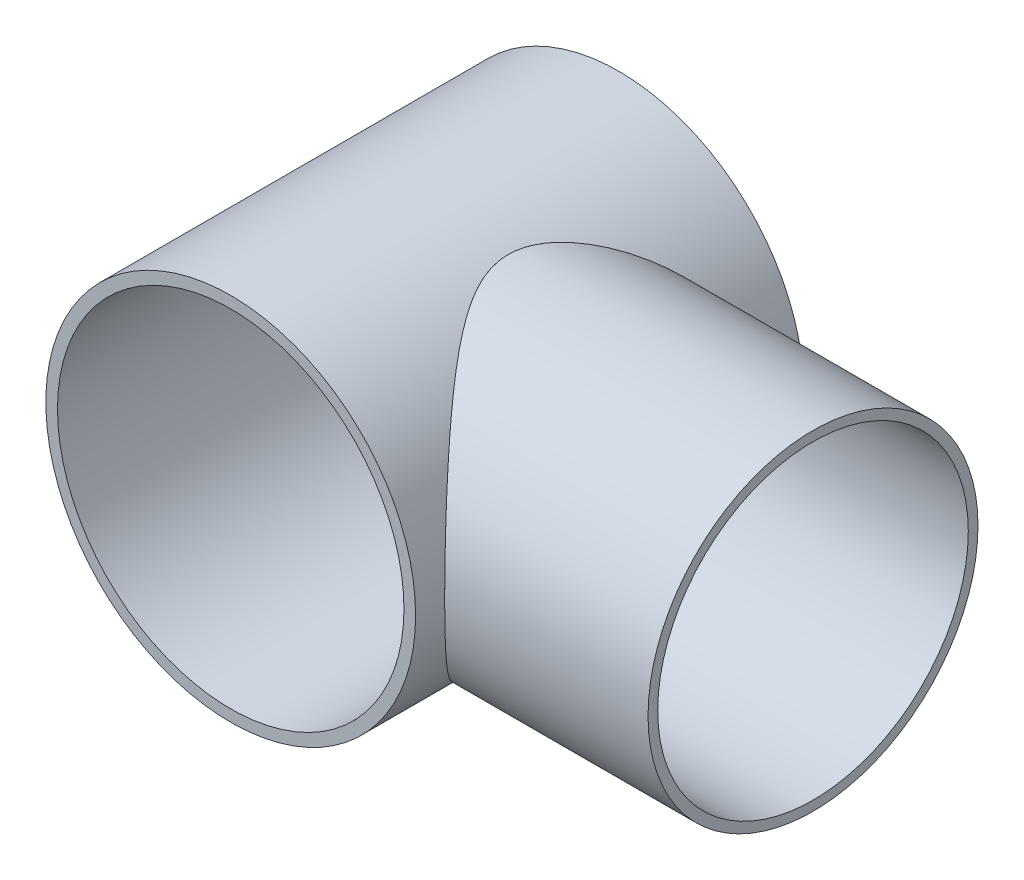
ISO-10303-21;
HEADER;
FILE_DESCRIPTION(('STEP AP214'),'2;1');
FILE_NAME('part.step','',(''),(''),'','','');
FILE_SCHEMA(('AUTOMOTIVE_DESIGN { 1 0 10303 214 1 1 1 1 }'));
ENDSEC;
DATA;
#1=APPLICATION_CONTEXT('core data for automotive mechanical design processes');
#2=APPLICATION_PROTOCOL_DEFINITION('international standard','automotive_design',2000,#1);
#3=PRODUCT_CONTEXT('',#1,'mechanical');
#4=PRODUCT('Part','Part','',(#3));
#5=PRODUCT_RELATED_PRODUCT_CATEGORY('part','',(#4));
#6=PRODUCT_DEFINITION_FORMATION('','',#4);
#7=PRODUCT_DEFINITION_CONTEXT('part definition',#1,'design');
#8=PRODUCT_DEFINITION('design','',#6,#7);
#9=PRODUCT_DEFINITION_SHAPE('','',#8);
#10=(LENGTH_UNIT() NAMED_UNIT(*) SI_UNIT(.MILLI.,.METRE.));
#11=(NAMED_UNIT(*) PLANE_ANGLE_UNIT() SI_UNIT($,.RADIAN.));
#12=(NAMED_UNIT(*) SI_UNIT($,.STERADIAN.) SOLID_ANGLE_UNIT());
#13=UNCERTAINTY_MEASURE_WITH_UNIT(LENGTH_MEASURE(1.E-05),#10,'distance_accuracy_value','');
#14=(GEOMETRIC_REPRESENTATION_CONTEXT(3) GLOBAL_UNCERTAINTY_ASSIGNED_CONTEXT((#13)) GLOBAL_UNIT_ASSIGNED_CONTEXT((#10,
#11,#12)) REPRESENTATION_CONTEXT('',''));
#15=CARTESIAN_POINT('',(0.,0.,0.));
#16=DIRECTION('',(0.,0.,1.));
#17=DIRECTION('',(1.,0.,0.));
#18=AXIS2_PLACEMENT_3D('',#15,#16,#17);
#19=CARTESIAN_POINT('',(0.,0.,60.));
#20=DIRECTION('',(0.,0.,-1.));
#21=DIRECTION('',(-1.,0.,0.));
#22=AXIS2_PLACEMENT_3D('',#19,#20,#21);
#23=CYLINDRICAL_SURFACE('',#22,57.15);
#24=CARTESIAN_POINT('',(57.15,0.,48.));
#25=CARTESIAN_POINT('',(57.1499996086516,0.568164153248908,47.9999996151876));
#26=CARTESIAN_POINT('',(57.1415224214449,1.13635020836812,47.989907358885));
#27=CARTESIAN_POINT('',(57.1076617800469,2.27156841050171,47.9495844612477));
#28=CARTESIAN_POINT('',(57.0822759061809,2.83860038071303,47.9193509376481));
#29=CARTESIAN_POINT('',(57.0147281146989,3.97048718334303,47.8388671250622));
#30=CARTESIAN_POINT('',(56.972559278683,4.53534102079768,47.7886085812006));
#31=CARTESIAN_POINT('',(56.8716980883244,5.66147537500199,47.6683185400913));
#32=CARTESIAN_POINT('',(56.813003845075,6.22275547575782,47.598284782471));
#33=CARTESIAN_POINT('',(56.6123467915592,7.90160580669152,47.3586647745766));
#34=CARTESIAN_POINT('',(56.4459239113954,9.0122944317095,47.1596954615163));
#35=CARTESIAN_POINT('',(56.0516584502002,11.2061120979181,46.6870734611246));
#36=CARTESIAN_POINT('',(55.8238229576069,12.2892443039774,46.4134293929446));
#37=CARTESIAN_POINT('',(55.3130777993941,14.4143012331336,45.7978536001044));
#38=CARTESIAN_POINT('',(55.0305450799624,15.4564523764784,45.4563888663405));
#39=CARTESIAN_POINT('',(54.4146526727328,17.501683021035,44.7088001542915));
#40=CARTESIAN_POINT('',(54.0812926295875,18.5047622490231,44.3026757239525));
#41=CARTESIAN_POINT('',(53.3693873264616,20.4675532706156,43.4307764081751));
#42=CARTESIAN_POINT('',(52.9908536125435,21.4272760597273,42.9650167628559));
#43=CARTESIAN_POINT('',(52.194072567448,23.3010293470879,41.9783684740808));
#44=CARTESIAN_POINT('',(51.7758167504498,24.2150500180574,41.4574680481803));
#45=CARTESIAN_POINT('',(51.0421508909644,25.7154248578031,40.5367711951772));
#46=CARTESIAN_POINT('',(50.7357260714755,26.3144851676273,40.1503589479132));
#47=CARTESIAN_POINT('',(50.1087477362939,27.4896234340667,39.3550993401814));
#48=CARTESIAN_POINT('',(49.7881972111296,28.0657062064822,38.9462567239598));
#49=CARTESIAN_POINT('',(48.8076236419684,29.7597145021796,37.6873910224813));
#50=CARTESIAN_POINT('',(48.1287960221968,30.8431624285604,36.8051766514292));
#51=CARTESIAN_POINT('',(46.73355749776,32.9190826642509,34.9609443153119));
#52=CARTESIAN_POINT('',(46.0170551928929,33.9113160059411,33.9987286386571));
#53=CARTESIAN_POINT('',(44.5619256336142,35.8019412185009,32.0017392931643));
#54=CARTESIAN_POINT('',(43.8233012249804,36.700345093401,30.9669749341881));
#55=CARTESIAN_POINT('',(42.7031106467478,37.9855033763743,29.3527900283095));
#56=CARTESIAN_POINT('',(42.3240986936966,38.4070892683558,28.7989553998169));
#57=CARTESIAN_POINT('',(41.5663491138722,39.2259112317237,27.6733141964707));
#58=CARTESIAN_POINT('',(41.1876114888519,39.623147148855,27.1015075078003));
#59=CARTESIAN_POINT('',(40.4326391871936,40.3932554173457,25.9397530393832));
#60=CARTESIAN_POINT('',(40.0564054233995,40.7661192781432,25.3497990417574));
#61=CARTESIAN_POINT('',(39.3091617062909,41.4871284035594,24.1517488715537));
#62=CARTESIAN_POINT('',(38.9381516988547,41.835273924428,23.5436528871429));
#63=CARTESIAN_POINT('',(38.2051188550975,42.5057351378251,22.3104002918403));
#64=CARTESIAN_POINT('',(37.8430772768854,42.828108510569,21.6852862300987));
#65=CARTESIAN_POINT('',(37.1303997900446,43.4474253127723,20.4161658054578));
#66=CARTESIAN_POINT('',(36.7797644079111,43.7443675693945,19.7721585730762));
#67=CARTESIAN_POINT('',(36.0939960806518,44.3118930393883,18.4651918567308));
#68=CARTESIAN_POINT('',(35.7588522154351,44.5824949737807,17.8022462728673));
#69=CARTESIAN_POINT('',(35.1083147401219,45.0965697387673,16.4565533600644));
#70=CARTESIAN_POINT('',(34.7929180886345,45.340046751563,15.7738091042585));
#71=CARTESIAN_POINT('',(34.1616253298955,45.8178488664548,14.3300405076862));
#72=CARTESIAN_POINT('',(33.8478866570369,46.0497120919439,13.5672401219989));
#73=CARTESIAN_POINT('',(33.4049043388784,46.3709847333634,12.4053685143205));
#74=CARTESIAN_POINT('',(33.2618570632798,46.4736488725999,12.0151612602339));
#75=CARTESIAN_POINT('',(32.9859355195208,46.669896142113,11.2287631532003));
#76=CARTESIAN_POINT('',(32.8530645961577,46.7634762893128,10.8325703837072));
#77=CARTESIAN_POINT('',(32.4719112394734,47.0297081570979,9.637017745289));
#78=CARTESIAN_POINT('',(32.2404336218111,47.1883220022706,8.82898973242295));
#79=CARTESIAN_POINT('',(31.8313029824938,47.4652704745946,7.19279017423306));
#80=CARTESIAN_POINT('',(31.6536345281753,47.5836166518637,6.36462447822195));
#81=CARTESIAN_POINT('',(31.3582319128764,47.7788219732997,4.68098175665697));
#82=CARTESIAN_POINT('',(31.2413370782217,47.855100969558,3.82528712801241));
#83=CARTESIAN_POINT('',(31.0776056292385,47.9615957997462,2.10435200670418));
#84=CARTESIAN_POINT('',(31.0307616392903,47.9918164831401,1.23911252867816));
#85=CARTESIAN_POINT('',(31.0099308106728,48.0052797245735,-0.492440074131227));
#86=CARTESIAN_POINT('',(31.0359278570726,47.9885326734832,-1.35875291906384));
#87=CARTESIAN_POINT('',(31.1591614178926,47.9086042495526,-3.08412115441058));
#88=CARTESIAN_POINT('',(31.2564060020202,47.845417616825,-3.94317571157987));
#89=CARTESIAN_POINT('',(31.5250665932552,47.668857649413,-5.7018393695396));
#90=CARTESIAN_POINT('',(31.7008817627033,47.5524967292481,-6.6004678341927));
#91=CARTESIAN_POINT('',(32.1172255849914,47.2722847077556,-8.37487274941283));
#92=CARTESIAN_POINT('',(32.3577634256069,47.1084268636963,-9.25064593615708));
#93=CARTESIAN_POINT('',(32.8932931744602,46.7360701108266,-10.978303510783));
#94=CARTESIAN_POINT('',(33.1884417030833,46.5274425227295,-11.8301108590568));
#95=CARTESIAN_POINT('',(33.8220543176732,46.068904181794,-13.5059617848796));
#96=CARTESIAN_POINT('',(34.1605227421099,45.8189892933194,-14.3300025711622));
#97=CARTESIAN_POINT('',(34.8011103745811,45.3335796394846,-15.7903815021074));
#98=CARTESIAN_POINT('',(35.0972310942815,45.1049635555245,-16.4316834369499));
#99=CARTESIAN_POINT('',(35.7070312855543,44.6237744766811,-17.6968027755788));
#100=CARTESIAN_POINT('',(36.0207130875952,44.3711982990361,-18.3206178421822));
#101=CARTESIAN_POINT('',(36.66202275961,43.8428023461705,-19.551404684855));
#102=CARTESIAN_POINT('',(36.9896575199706,43.5669710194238,-20.1583678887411));
#103=CARTESIAN_POINT('',(37.655479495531,42.9927974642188,-21.3555632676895));
#104=CARTESIAN_POINT('',(37.9936663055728,42.694456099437,-21.9457960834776));
#105=CARTESIAN_POINT('',(38.6782410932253,42.0752826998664,-23.1107393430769));
#106=CARTESIAN_POINT('',(39.0246393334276,41.7544214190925,-23.6854282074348));
#107=CARTESIAN_POINT('',(39.7227266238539,41.0908702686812,-24.818774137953));
#108=CARTESIAN_POINT('',(40.0744161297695,40.7481785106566,-25.3774298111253));
#109=CARTESIAN_POINT('',(41.1338626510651,39.687843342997,-27.0293905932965));
#110=CARTESIAN_POINT('',(41.8462918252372,38.9376771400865,-28.0991829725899));
#111=CARTESIAN_POINT('',(42.9332734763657,37.7249930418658,-29.6867443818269));
#112=CARTESIAN_POINT('',(43.3091053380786,37.2931771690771,-30.227446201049));
#113=CARTESIAN_POINT('',(44.0578782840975,36.4055349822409,-31.290842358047));
#114=CARTESIAN_POINT('',(44.4308193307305,35.9497083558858,-31.8135364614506));
#115=CARTESIAN_POINT('',(45.5425218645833,34.5459877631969,-33.3542441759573));
#116=CARTESIAN_POINT('',(46.2741965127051,33.5618158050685,-34.3449320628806));
#117=CARTESIAN_POINT('',(47.3452987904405,32.0146588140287,-35.770830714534));
#118=CARTESIAN_POINT('',(47.6976746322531,31.4875488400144,-36.2357789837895));
#119=CARTESIAN_POINT('',(48.3921632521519,30.4094062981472,-37.1451922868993));
#120=CARTESIAN_POINT('',(48.7342766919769,29.8583752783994,-37.5896586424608));
#121=CARTESIAN_POINT('',(49.4063030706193,28.7327213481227,-38.4569283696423));
#122=CARTESIAN_POINT('',(49.7362203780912,28.1581070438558,-38.879739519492));
#123=CARTESIAN_POINT('',(50.3822401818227,26.9851958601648,-39.7028039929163));
#124=CARTESIAN_POINT('',(50.6983392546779,26.3868931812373,-40.1030517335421));
#125=CARTESIAN_POINT('',(51.4823012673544,24.835605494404,-41.0906048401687));
#126=CARTESIAN_POINT('',(51.9393266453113,23.8665044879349,-41.6614131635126));
#127=CARTESIAN_POINT('',(52.8089110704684,21.8751253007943,-42.7406206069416));
#128=CARTESIAN_POINT('',(53.2214803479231,20.8528594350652,-43.249034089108));
#129=CARTESIAN_POINT('',(53.801718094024,19.2823598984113,-43.9604493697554));
#130=CARTESIAN_POINT('',(53.9886970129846,18.752668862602,-44.1890565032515));
#131=CARTESIAN_POINT('',(54.3489483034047,17.6814443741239,-44.6284833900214));
#132=CARTESIAN_POINT('',(54.5222228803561,17.1399128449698,-44.8393060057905));
#133=CARTESIAN_POINT('',(54.854260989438,16.0455474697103,-45.2424636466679));
#134=CARTESIAN_POINT('',(55.0130226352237,15.4927121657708,-45.4347962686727));
#135=CARTESIAN_POINT('',(55.3151932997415,14.3765825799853,-45.8002037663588));
#136=CARTESIAN_POINT('',(55.4586026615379,13.813288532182,-45.9732790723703));
#137=CARTESIAN_POINT('',(55.7304414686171,12.6723016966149,-46.3008426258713));
#138=CARTESIAN_POINT('',(55.8587337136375,12.094527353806,-46.4551609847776));
#139=CARTESIAN_POINT('',(56.0981578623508,10.9303380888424,-46.7427766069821));
#140=CARTESIAN_POINT('',(56.2092921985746,10.3439244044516,-46.8760768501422));
#141=CARTESIAN_POINT('',(56.4137667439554,9.1634227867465,-47.1210688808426));
#142=CARTESIAN_POINT('',(56.5071041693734,8.56933366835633,-47.2327572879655));
#143=CARTESIAN_POINT('',(56.6753665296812,7.37489182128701,-47.4339299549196));
#144=CARTESIAN_POINT('',(56.7502937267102,6.77453987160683,-47.5234169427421));
#145=CARTESIAN_POINT('',(56.8812307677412,5.56914844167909,-47.6796993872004));
#146=CARTESIAN_POINT('',(56.937250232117,4.96411150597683,-47.74650638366));
#147=CARTESIAN_POINT('',(57.0300464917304,3.75054726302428,-47.8571270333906));
#148=CARTESIAN_POINT('',(57.0668257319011,3.1420204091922,-47.9009436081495));
#149=CARTESIAN_POINT('',(57.1209000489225,1.92288640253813,-47.9653524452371));
#150=CARTESIAN_POINT('',(57.138195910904,1.31227933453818,-47.9859456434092));
#151=CARTESIAN_POINT('',(57.1531952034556,0.0905453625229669,-48.0038042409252));
#152=CARTESIAN_POINT('',(57.1508992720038,-0.520581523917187,-48.00107039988));
#153=CARTESIAN_POINT('',(57.1177328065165,-2.19491603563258,-47.9615808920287));
#154=CARTESIAN_POINT('',(57.0669365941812,-3.25733100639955,-47.9011012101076));
#155=CARTESIAN_POINT('',(56.906916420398,-5.37115836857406,-47.7103477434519));
#156=CARTESIAN_POINT('',(56.7976984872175,-6.42257188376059,-47.5800811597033));
#157=CARTESIAN_POINT('',(56.5230313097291,-8.5073376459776,-47.2518638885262));
#158=CARTESIAN_POINT('',(56.3575804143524,-9.54068936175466,-47.0539112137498));
#159=CARTESIAN_POINT('',(55.9735795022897,-11.5827694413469,-46.5932963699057));
#160=CARTESIAN_POINT('',(55.7550270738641,-12.591496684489,-46.3306312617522));
#161=CARTESIAN_POINT('',(55.2684159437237,-14.5799056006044,-45.7438760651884));
#162=CARTESIAN_POINT('',(55.0003015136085,-15.5595531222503,-45.4197168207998));
#163=CARTESIAN_POINT('',(54.4190949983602,-17.4841401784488,-44.7141521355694));
#164=CARTESIAN_POINT('',(54.1060042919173,-18.4290807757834,-44.3327484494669));
#165=CARTESIAN_POINT('',(53.4394043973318,-20.2810609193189,-43.5166962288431));
#166=CARTESIAN_POINT('',(53.085887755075,-21.1880934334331,-43.0820378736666));
#167=CARTESIAN_POINT('',(52.3431083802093,-22.9618417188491,-42.1633914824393));
#168=CARTESIAN_POINT('',(51.9538384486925,-23.8285493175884,-41.679393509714));
#169=CARTESIAN_POINT('',(51.2567508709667,-25.2849100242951,-40.8066231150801));
#170=CARTESIAN_POINT('',(50.9563225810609,-25.8846793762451,-40.4287172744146));
#171=CARTESIAN_POINT('',(50.3411249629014,-27.0616814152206,-39.6505114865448));
#172=CARTESIAN_POINT('',(50.0263582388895,-27.6389181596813,-39.2502156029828));
#173=CARTESIAN_POINT('',(49.0627682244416,-29.3370247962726,-38.017057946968));
#174=CARTESIAN_POINT('',(48.3947824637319,-30.4240277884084,-37.1520848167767));
#175=CARTESIAN_POINT('',(47.020040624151,-32.5084880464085,-35.3427320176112));
#176=CARTESIAN_POINT('',(46.313191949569,-33.5057150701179,-34.3981595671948));
#177=CARTESIAN_POINT('',(44.8757571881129,-35.4077491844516,-32.4369692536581));
#178=CARTESIAN_POINT('',(44.1451742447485,-36.3125684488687,-31.4203609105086));
#179=CARTESIAN_POINT('',(43.035732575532,-37.6082425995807,-29.834497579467));
#180=CARTESIAN_POINT('',(42.66022402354,-38.0334041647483,-29.2905521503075));
#181=CARTESIAN_POINT('',(41.9088607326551,-38.8597678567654,-28.1850087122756));
#182=CARTESIAN_POINT('',(41.5330060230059,-39.260971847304,-27.623412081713));
#183=CARTESIAN_POINT('',(40.7830267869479,-40.039474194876,-26.4824032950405));
#184=CARTESIAN_POINT('',(40.4089029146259,-40.4167641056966,-25.9029849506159));
#185=CARTESIAN_POINT('',(39.6649576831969,-41.1471179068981,-24.7263854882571));
#186=CARTESIAN_POINT('',(39.2951362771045,-41.5001820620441,-24.1292045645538));
#187=CARTESIAN_POINT('',(38.5632692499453,-42.1811102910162,-22.9180197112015));
#188=CARTESIAN_POINT('',(38.2012094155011,-42.5090238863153,-22.3040522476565));
#189=CARTESIAN_POINT('',(37.4871722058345,-43.1400209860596,-21.0576948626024));
#190=CARTESIAN_POINT('',(37.1351953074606,-43.4431033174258,-20.4253040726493));
#191=CARTESIAN_POINT('',(36.4451168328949,-44.0236198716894,-19.1420098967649));
#192=CARTESIAN_POINT('',(36.1070067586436,-44.3010699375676,-18.491118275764));
#193=CARTESIAN_POINT('',(35.4486139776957,-44.8296382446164,-17.1700210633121));
#194=CARTESIAN_POINT('',(35.1283284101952,-45.0807607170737,-16.4998185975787));
#195=CARTESIAN_POINT('',(34.4757924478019,-45.5821216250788,-15.0635815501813));
#196=CARTESIAN_POINT('',(34.1461962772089,-45.8291333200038,-14.2951996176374));
#197=CARTESIAN_POINT('',(33.5224989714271,-46.2873021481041,-12.7337166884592));
#198=CARTESIAN_POINT('',(33.2283934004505,-46.4984637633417,-11.9406187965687));
#199=CARTESIAN_POINT('',(32.6847621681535,-46.8821869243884,-10.3316527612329));
#200=CARTESIAN_POINT('',(32.4351567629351,-47.0548176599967,-9.51582844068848));
#201=CARTESIAN_POINT('',(31.98909455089,-47.3591952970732,-7.86215065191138));
#202=CARTESIAN_POINT('',(31.7926376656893,-47.4909422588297,-7.02429721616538));
#203=CARTESIAN_POINT('',(31.4594517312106,-47.7123308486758,-5.31818689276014));
#204=CARTESIAN_POINT('',(31.323624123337,-47.8013384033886,-4.44966587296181));
#205=CARTESIAN_POINT('',(31.1734224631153,-47.8993059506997,-3.13833481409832));
#206=CARTESIAN_POINT('',(31.1322765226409,-47.9260390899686,-2.69973748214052));
#207=CARTESIAN_POINT('',(31.0683983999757,-47.9674749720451,-1.82065640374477));
#208=CARTESIAN_POINT('',(31.0456637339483,-47.9821793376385,-1.38017291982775));
#209=CARTESIAN_POINT('',(31.0189787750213,-47.9994342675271,-0.498616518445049));
#210=CARTESIAN_POINT('',(31.0150194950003,-48.0019906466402,-0.0575439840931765));
#211=CARTESIAN_POINT('',(31.0259173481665,-47.9949476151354,0.824254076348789));
#212=CARTESIAN_POINT('',(31.0407737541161,-47.985348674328,1.26497961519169));
#213=CARTESIAN_POINT('',(31.0890715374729,-47.9540713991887,2.14495820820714));
#214=CARTESIAN_POINT('',(31.1225119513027,-47.9323936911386,2.584211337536));
#215=CARTESIAN_POINT('',(31.2074586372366,-47.8771296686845,3.4602268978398));
#216=CARTESIAN_POINT('',(31.2589666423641,-47.8435422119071,3.89698908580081));
#217=CARTESIAN_POINT('',(31.4216361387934,-47.7369725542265,5.07291435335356));
#218=CARTESIAN_POINT('',(31.5492801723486,-47.652893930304,5.80885891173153));
#219=CARTESIAN_POINT('',(31.8499754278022,-47.4524391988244,7.26690532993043));
#220=CARTESIAN_POINT('',(32.0230329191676,-47.336058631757,7.98900526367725));
#221=CARTESIAN_POINT('',(32.3124033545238,-47.1385692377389,9.06021305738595));
#222=CARTESIAN_POINT('',(32.4139090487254,-47.0688605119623,9.41554653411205));
#223=CARTESIAN_POINT('',(32.6260702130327,-46.9220491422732,10.1218254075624));
#224=CARTESIAN_POINT('',(32.7367233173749,-46.8449484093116,10.4727719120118));
#225=CARTESIAN_POINT('',(33.0813868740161,-46.6028232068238,11.5190939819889));
#226=CARTESIAN_POINT('',(33.3280738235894,-46.4269945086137,12.2078508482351));
#227=CARTESIAN_POINT('',(33.8235719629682,-46.0670457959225,13.4992959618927));
#228=CARTESIAN_POINT('',(34.0697337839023,-45.8854879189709,14.1037334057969));
#229=CARTESIAN_POINT('',(34.5811074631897,-45.5013382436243,15.2977632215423));
#230=CARTESIAN_POINT('',(34.8463219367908,-45.2987435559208,15.8873535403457));
#231=CARTESIAN_POINT('',(35.3925627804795,-44.8732536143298,17.0521505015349));
#232=CARTESIAN_POINT('',(35.6735987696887,-44.6503459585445,17.6273480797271));
#233=CARTESIAN_POINT('',(36.2483420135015,-44.1850323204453,18.7632491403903));
#234=CARTESIAN_POINT('',(36.5420487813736,-43.9426270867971,19.3239531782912));
#235=CARTESIAN_POINT('',(37.4396081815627,-43.1857684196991,20.9875449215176));
#236=CARTESIAN_POINT('',(38.0586682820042,-42.6426174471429,22.069340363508));
#237=CARTESIAN_POINT('',(39.3192728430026,-41.4831468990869,24.178424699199));
#238=CARTESIAN_POINT('',(39.960812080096,-40.8668442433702,25.2057261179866));
#239=CARTESIAN_POINT('',(41.2969223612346,-39.5176972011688,27.2760052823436));
#240=CARTESIAN_POINT('',(41.9921246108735,-38.7797697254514,28.3152681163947));
#241=CARTESIAN_POINT('',(43.378722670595,-37.2222594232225,30.3336156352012));
#242=CARTESIAN_POINT('',(44.0701180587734,-36.4026677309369,31.312693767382));
#243=CARTESIAN_POINT('',(45.4358861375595,-34.68295116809,33.2073402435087));
#244=CARTESIAN_POINT('',(46.1102792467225,-33.7829294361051,34.1229873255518));
#245=CARTESIAN_POINT('',(47.4314366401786,-31.9014476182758,35.8881732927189));
#246=CARTESIAN_POINT('',(48.0782044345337,-30.9199979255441,36.737720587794));
#247=CARTESIAN_POINT('',(49.2715251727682,-28.9760270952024,38.2854924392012));
#248=CARTESIAN_POINT('',(49.8216935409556,-28.021037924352,38.9903909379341));
#249=CARTESIAN_POINT('',(50.8821491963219,-26.0458286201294,40.3366154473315));
#250=CARTESIAN_POINT('',(51.3924361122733,-25.0256078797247,40.9779408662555));
#251=CARTESIAN_POINT('',(52.1212758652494,-23.4484705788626,41.8872007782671));
#252=CARTESIAN_POINT('',(52.3581179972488,-22.9149724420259,42.1814920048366));
#253=CARTESIAN_POINT('',(52.8185815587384,-21.8326740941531,42.7517060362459));
#254=CARTESIAN_POINT('',(53.0422039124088,-21.2838749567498,43.0276301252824));
#255=CARTESIAN_POINT('',(53.4750796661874,-20.1716228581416,43.5601386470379));
#256=CARTESIAN_POINT('',(53.6843370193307,-19.6081739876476,43.8167284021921));
#257=CARTESIAN_POINT('',(54.0875147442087,-18.4669880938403,44.3097831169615));
#258=CARTESIAN_POINT('',(54.2814310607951,-17.8892473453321,44.5462427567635));
#259=CARTESIAN_POINT('',(54.7790822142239,-16.3228541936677,45.1516574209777));
#260=CARTESIAN_POINT('',(55.0678498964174,-15.3218727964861,45.5013988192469));
#261=CARTESIAN_POINT('',(55.5939890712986,-13.2866468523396,46.1367624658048));
#262=CARTESIAN_POINT('',(55.8313699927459,-12.252408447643,46.4223964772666));
#263=CARTESIAN_POINT('',(56.1454219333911,-10.6817083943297,46.7994729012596));
#264=CARTESIAN_POINT('',(56.2430333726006,-10.1554023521,46.9165199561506));
#265=CARTESIAN_POINT('',(56.4239143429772,-9.09684147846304,47.1332068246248));
#266=CARTESIAN_POINT('',(56.5071864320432,-8.56458772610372,47.2328497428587));
#267=CARTESIAN_POINT('',(56.6589487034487,-7.49517125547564,47.414306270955));
#268=CARTESIAN_POINT('',(56.7274446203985,-6.95801052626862,47.4961267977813));
#269=CARTESIAN_POINT('',(56.8493434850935,-5.87955947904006,47.641651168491));
#270=CARTESIAN_POINT('',(56.9027463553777,-5.33826913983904,47.7053549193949));
#271=CARTESIAN_POINT('',(57.0153654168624,-4.00075194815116,47.8396418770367));
#272=CARTESIAN_POINT('',(57.0658003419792,-3.20266605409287,47.8997244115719));
#273=CARTESIAN_POINT('',(57.1162889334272,-2.00311295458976,47.9598587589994));
#274=CARTESIAN_POINT('',(57.1289245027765,-1.60281735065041,47.9749053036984));
#275=CARTESIAN_POINT('',(57.1457812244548,-0.801684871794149,47.9949773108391));
#276=CARTESIAN_POINT('',(57.1500002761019,-0.400847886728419,48.0000002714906));
#277=CARTESIAN_POINT('',(57.15,0.,48.));
#278=B_SPLINE_CURVE_WITH_KNOTS('',3,(#24,#25,#26,#27,#28,#29,#30,#31,#32,#33,#34,#35,#36,#37,
#38,#39,#40,#41,#42,#43,#44,#45,#46,#47,#48,#49,#50,#51,#52,#53,#54,#55,#56,#57,#58,#59,#60,#61,
#62,#63,#64,#65,#66,#67,#68,#69,#70,#71,#72,#73,#74,#75,#76,#77,#78,#79,#80,#81,#82,#83,#84,#85,
#86,#87,#88,#89,#90,#91,#92,#93,#94,#95,#96,#97,#98,#99,#100,#101,#102,#103,#104,#105,#106,#107,
#108,#109,#110,#111,#112,#113,#114,#115,#116,#117,#118,#119,#120,#121,#122,#123,#124,#125,#126,
#127,#128,#129,#130,#131,#132,#133,#134,#135,#136,#137,#138,#139,#140,#141,#142,#143,#144,#145,
#146,#147,#148,#149,#150,#151,#152,#153,#154,#155,#156,#157,#158,#159,#160,#161,#162,#163,#164,
#165,#166,#167,#168,#169,#170,#171,#172,#173,#174,#175,#176,#177,#178,#179,#180,#181,#182,#183,
#184,#185,#186,#187,#188,#189,#190,#191,#192,#193,#194,#195,#196,#197,#198,#199,#200,#201,#202,
#203,#204,#205,#206,#207,#208,#209,#210,#211,#212,#213,#214,#215,#216,#217,#218,#219,#220,#221,
#222,#223,#224,#225,#226,#227,#228,#229,#230,#231,#232,#233,#234,#235,#236,#237,#238,#239,#240,
#241,#242,#243,#244,#245,#246,#247,#248,#249,#250,#251,#252,#253,#254,#255,#256,#257,#258,#259,
#260,#261,#262,#263,#264,#265,#266,#267,#268,#269,#270,#271,#272,#273,#274,#275,#276,#277),
.UNSPECIFIED.,.T.,.F.,(4,2,2,2,2,2,2,2,2,2,2,2,2,2,2,2,2,2,2,2,2,2,2,2,2,2,2,2,2,2,2,2,2,2,2,2,
2,2,2,2,2,2,2,2,2,2,2,2,2,2,2,2,2,2,2,2,2,2,2,2,2,2,2,2,2,2,2,2,2,2,2,2,2,2,2,2,2,2,2,2,2,2,2,2,
2,2,2,2,2,2,2,2,2,2,2,2,2,2,2,2,2,2,2,2,2,2,2,2,2,2,2,2,2,2,2,2,2,2,2,2,2,2,2,2,2,2,4),(0.,
1.70437660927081,3.40899717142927,5.11432115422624,6.8198401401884,10.2365566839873,
13.6528790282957,17.0464459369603,20.440036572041,23.8327616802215,27.2262132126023,
29.5532627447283,31.8798219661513,36.5338457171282,41.1997340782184,45.8650247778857,
48.2421750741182,50.6193404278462,52.9973295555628,55.3752940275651,57.747778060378,
60.1203714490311,62.4912660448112,64.8617945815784,67.4302674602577,68.7143207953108,
69.9987943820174,72.5621267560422,75.1247232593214,77.7218290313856,80.3186613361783,
82.9149191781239,85.5114711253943,88.2763297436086,91.0415810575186,93.8148894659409,
96.588475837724,98.8149897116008,101.041799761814,103.269722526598,105.497559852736,
107.728345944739,109.959325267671,114.419392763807,116.781253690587,119.143145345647,
123.866718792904,126.224939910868,128.583008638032,130.940224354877,133.29802078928,
136.936640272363,140.574420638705,142.393362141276,144.212010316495,146.030894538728,
147.849738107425,149.683990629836,151.517982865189,153.352261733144,155.186315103,
157.019433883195,158.852319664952,160.685131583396,162.517883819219,165.709619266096,
168.90102543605,172.09252531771,175.284170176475,178.479425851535,181.674583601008,
184.870331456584,188.066724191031,190.375734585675,192.684327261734,197.302507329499,
201.932212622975,206.561307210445,208.91856619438,211.275641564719,213.633544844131,
215.991422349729,218.344531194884,220.697751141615,223.049506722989,225.400883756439,
228.01469355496,230.628176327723,233.236927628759,235.845675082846,238.492013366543,
239.81555348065,241.138915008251,242.461643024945,243.784319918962,245.106928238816,
246.429663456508,248.682088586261,250.934824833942,252.062838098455,253.190560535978,
255.446324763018,257.4778279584,259.509610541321,261.54264202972,263.575595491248,
267.650490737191,271.724445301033,276.076433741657,280.428895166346,284.775853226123,
289.122257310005,293.043689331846,296.965157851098,298.925784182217,300.886273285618,
302.846220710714,304.806684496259,308.099968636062,311.392647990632,313.036019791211,
314.679098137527,316.321537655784,317.963985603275,320.367824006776,321.569985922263,
322.772447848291),.UNSPECIFIED.);
#279=CARTESIAN_POINT('',(57.15,0.,48.));
#280=VERTEX_POINT('',#279);
#281=EDGE_CURVE('E50',#280,#280,#278,.T.);
#282=ORIENTED_EDGE('',*,*,#281,.F.);
#283=EDGE_LOOP('',(#282));
#284=FACE_BOUND('',#283,.T.);
#285=CARTESIAN_POINT('',(57.15,0.,51.));
#286=CARTESIAN_POINT('',(57.1500006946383,0.592506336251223,51.0000007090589));
#287=CARTESIAN_POINT('',(57.1407816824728,1.1849978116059,50.9896706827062));
#288=CARTESIAN_POINT('',(57.10395946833,2.368749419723,50.9484030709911));
#289=CARTESIAN_POINT('',(57.0763546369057,2.960009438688,50.9174636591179));
#290=CARTESIAN_POINT('',(57.0029086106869,4.14011006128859,50.8351201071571));
#291=CARTESIAN_POINT('',(56.957062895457,4.72895002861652,50.7837108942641));
#292=CARTESIAN_POINT('',(56.8473918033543,5.90289321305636,50.6606773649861));
#293=CARTESIAN_POINT('',(56.7835643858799,6.48799599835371,50.5890507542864));
#294=CARTESIAN_POINT('',(56.6381976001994,7.65392425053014,50.425829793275));
#295=CARTESIAN_POINT('',(56.5566371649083,8.23474377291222,50.3342116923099));
#296=CARTESIAN_POINT('',(56.3762982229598,9.39029820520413,50.1314933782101));
#297=CARTESIAN_POINT('',(56.2775177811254,9.96503242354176,50.0203909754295));
#298=CARTESIAN_POINT('',(55.9561334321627,11.6782952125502,49.6586221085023));
#299=CARTESIAN_POINT('',(55.7084313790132,12.8063218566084,49.3794322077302));
#300=CARTESIAN_POINT('',(55.1529625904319,15.0188712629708,48.7519015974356));
#301=CARTESIAN_POINT('',(54.8456075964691,16.1036340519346,48.4040346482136));
#302=CARTESIAN_POINT('',(54.1752130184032,18.2322170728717,47.6430857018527));
#303=CARTESIAN_POINT('',(53.8121737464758,19.2760375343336,47.2300040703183));
#304=CARTESIAN_POINT('',(53.0361853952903,21.3185205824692,46.3439338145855));
#305=CARTESIAN_POINT('',(52.6232373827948,22.317184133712,45.8709464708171));
#306=CARTESIAN_POINT('',(51.7531032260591,24.2668208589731,44.8700612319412));
#307=CARTESIAN_POINT('',(51.2959072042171,25.2177833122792,44.3421510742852));
#308=CARTESIAN_POINT('',(50.487405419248,26.7893946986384,43.403845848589));
#309=CARTESIAN_POINT('',(50.1459571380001,27.4228683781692,43.0062722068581));
#310=CARTESIAN_POINT('',(49.4463285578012,28.6651573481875,42.1884070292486));
#311=CARTESIAN_POINT('',(49.08815177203,29.2739777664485,41.7681202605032));
#312=CARTESIAN_POINT('',(47.9908390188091,31.0638123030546,40.474771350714));
#313=CARTESIAN_POINT('',(47.229062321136,32.2079270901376,39.569384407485));
#314=CARTESIAN_POINT('',(45.6579460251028,34.3990822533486,37.6802519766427));
#315=CARTESIAN_POINT('',(44.8485055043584,35.4459035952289,36.6963385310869));
#316=CARTESIAN_POINT('',(43.1970224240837,37.4408236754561,34.6585841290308));
#317=CARTESIAN_POINT('',(42.3549841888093,38.3889354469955,33.6047524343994));
#318=CARTESIAN_POINT('',(41.068334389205,39.7481562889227,31.9625427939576));
#319=CARTESIAN_POINT('',(40.630525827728,40.1953333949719,31.3982801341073));
#320=CARTESIAN_POINT('',(39.7519528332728,41.0644175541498,30.2527772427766));
#321=CARTESIAN_POINT('',(39.3111883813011,41.486324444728,29.6715369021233));
#322=CARTESIAN_POINT('',(38.4287107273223,42.3050718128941,28.4920420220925));
#323=CARTESIAN_POINT('',(37.9869972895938,42.7019050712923,27.8937826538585));
#324=CARTESIAN_POINT('',(37.105059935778,43.4704393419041,26.6802684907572));
#325=CARTESIAN_POINT('',(36.6648360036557,43.8421406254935,26.0650138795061));
#326=CARTESIAN_POINT('',(35.7892857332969,44.5597272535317,24.8182815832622));
#327=CARTESIAN_POINT('',(35.3539519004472,44.9056586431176,24.1868356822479));
#328=CARTESIAN_POINT('',(34.4903391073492,45.5723221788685,22.9059980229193));
#329=CARTESIAN_POINT('',(34.0620604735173,45.8930531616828,22.2566054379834));
#330=CARTESIAN_POINT('',(33.2163642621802,46.5088059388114,20.9394179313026));
#331=CARTESIAN_POINT('',(32.7989405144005,46.8038425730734,20.2716339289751));
#332=CARTESIAN_POINT('',(31.9790146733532,47.3678438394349,18.9162912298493));
#333=CARTESIAN_POINT('',(31.576510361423,47.636812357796,18.2287355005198));
#334=CARTESIAN_POINT('',(30.7891134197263,48.1495070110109,16.8280904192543));
#335=CARTESIAN_POINT('',(30.4043462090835,48.3930653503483,16.1148686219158));
#336=CARTESIAN_POINT('',(29.6616720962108,48.8517979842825,14.6655887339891));
#337=CARTESIAN_POINT('',(29.3037641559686,49.0669733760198,13.9295315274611));
#338=CARTESIAN_POINT('',(28.6231603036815,49.4670888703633,12.4340527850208));
#339=CARTESIAN_POINT('',(28.3004312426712,49.6520575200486,11.6746541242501));
#340=CARTESIAN_POINT('',(27.6994916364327,49.9897943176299,10.1313396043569));
#341=CARTESIAN_POINT('',(27.4212738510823,50.1425677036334,9.34742775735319));
#342=CARTESIAN_POINT('',(26.9620590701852,50.3907366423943,7.88837086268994));
#343=CARTESIAN_POINT('',(26.7725887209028,50.4914488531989,7.21681238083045));
#344=CARTESIAN_POINT('',(26.4389701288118,50.6669418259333,5.85911952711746));
#345=CARTESIAN_POINT('',(26.2948168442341,50.7417254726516,5.17298678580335));
#346=CARTESIAN_POINT('',(26.0582020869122,50.863645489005,3.7907509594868));
#347=CARTESIAN_POINT('',(25.9656370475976,50.9108372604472,3.09467074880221));
#348=CARTESIAN_POINT('',(25.8362938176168,50.9766004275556,1.69594939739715));
#349=CARTESIAN_POINT('',(25.7995132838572,50.9951730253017,0.993308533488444));
#350=CARTESIAN_POINT('',(25.7836635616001,51.0031890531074,-0.415260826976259));
#351=CARTESIAN_POINT('',(25.804796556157,50.9925304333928,-1.12119223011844));
#352=CARTESIAN_POINT('',(25.9040631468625,50.9421733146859,-2.5279407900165));
#353=CARTESIAN_POINT('',(25.9821983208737,50.9024740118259,-3.22875780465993));
#354=CARTESIAN_POINT('',(26.191696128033,50.7949927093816,-4.62141828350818));
#355=CARTESIAN_POINT('',(26.3231562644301,50.7271592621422,-5.31324290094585));
#356=CARTESIAN_POINT('',(26.6334159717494,50.5649502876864,-6.68294578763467));
#357=CARTESIAN_POINT('',(26.8122229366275,50.4705706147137,-7.36082186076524));
#358=CARTESIAN_POINT('',(27.3077666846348,50.2047921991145,-9.02761757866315));
#359=CARTESIAN_POINT('',(27.649220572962,50.0182885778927,-10.0067905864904));
#360=CARTESIAN_POINT('',(28.400694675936,49.5954504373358,-11.9272697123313));
#361=CARTESIAN_POINT('',(28.8107565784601,49.3590855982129,-12.8685523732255));
#362=CARTESIAN_POINT('',(29.6826591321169,48.8397449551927,-14.7174891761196));
#363=CARTESIAN_POINT('',(30.1446760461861,48.5566088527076,-15.625014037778));
#364=CARTESIAN_POINT('',(31.1048342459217,47.9472122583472,-17.4054644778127));
#365=CARTESIAN_POINT('',(31.6029723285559,47.620955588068,-18.2783931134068));
#366=CARTESIAN_POINT('',(32.5677962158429,46.9655500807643,-19.8975610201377));
#367=CARTESIAN_POINT('',(33.0318614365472,46.6407175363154,-20.6471292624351));
#368=CARTESIAN_POINT('',(33.9738056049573,45.9591236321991,-22.1228300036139));
#369=CARTESIAN_POINT('',(34.4516865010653,45.6023577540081,-22.8489591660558));
#370=CARTESIAN_POINT('',(35.416510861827,44.8571635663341,-24.279323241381));
#371=CARTESIAN_POINT('',(35.9034596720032,44.4687160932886,-24.9835445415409));
#372=CARTESIAN_POINT('',(36.8819836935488,43.6605595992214,-26.3704306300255));
#373=CARTESIAN_POINT('',(37.3735586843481,43.240852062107,-27.0530964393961));
#374=CARTESIAN_POINT('',(38.3576622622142,42.3703164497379,-28.3971319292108));
#375=CARTESIAN_POINT('',(38.8501904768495,41.9194987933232,-29.0585086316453));
#376=CARTESIAN_POINT('',(39.8332630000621,40.986497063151,-30.3603086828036));
#377=CARTESIAN_POINT('',(40.3238072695,40.5043123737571,-31.0007316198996));
#378=CARTESIAN_POINT('',(41.2998809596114,39.5085835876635,-32.2601289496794));
#379=CARTESIAN_POINT('',(41.7854123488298,38.9950523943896,-32.8791120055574));
#380=CARTESIAN_POINT('',(42.7489718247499,37.9362669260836,-34.0953018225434));
#381=CARTESIAN_POINT('',(43.2270002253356,37.3910139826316,-34.6925094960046));
#382=CARTESIAN_POINT('',(44.478299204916,35.9062884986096,-36.2425304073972));
#383=CARTESIAN_POINT('',(45.2430856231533,34.9394251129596,-37.1761996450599));
#384=CARTESIAN_POINT('',(46.7344049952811,32.9180079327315,-38.9773871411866));
#385=CARTESIAN_POINT('',(47.4609368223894,31.863451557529,-39.8449034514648));
#386=CARTESIAN_POINT('',(48.5126615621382,30.2170098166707,-41.0902043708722));
#387=CARTESIAN_POINT('',(48.8566645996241,29.6578399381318,-41.4957127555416));
#388=CARTESIAN_POINT('',(49.5307612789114,28.5177943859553,-42.2873139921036));
#389=CARTESIAN_POINT('',(49.8608558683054,27.9369201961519,-42.6734081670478));
#390=CARTESIAN_POINT('',(50.5055175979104,26.7538566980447,-43.4249014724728));
#391=CARTESIAN_POINT('',(50.8200895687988,26.1516741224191,-43.7903070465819));
#392=CARTESIAN_POINT('',(51.4323243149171,24.9260495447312,-44.4993647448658));
#393=CARTESIAN_POINT('',(51.7299827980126,24.3026022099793,-44.8430113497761));
#394=CARTESIAN_POINT('',(52.4705681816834,22.6749603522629,-45.6957849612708));
#395=CARTESIAN_POINT('',(52.8999786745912,21.6556355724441,-46.1880395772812));
#396=CARTESIAN_POINT('',(53.7067700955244,19.5692491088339,-47.1099179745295));
#397=CARTESIAN_POINT('',(54.0841627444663,18.5021982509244,-47.5395558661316));
#398=CARTESIAN_POINT('',(54.6065330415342,16.8693792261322,-48.1327297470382));
#399=CARTESIAN_POINT('',(54.7733705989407,16.3197301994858,-48.3219078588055));
#400=CARTESIAN_POINT('',(55.0917515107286,15.2103339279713,-48.6824995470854));
#401=CARTESIAN_POINT('',(55.2432974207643,14.6505883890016,-48.8539160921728));
#402=CARTESIAN_POINT('',(55.5304055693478,13.5216803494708,-49.1783402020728));
#403=CARTESIAN_POINT('',(55.6659662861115,12.9525169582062,-49.3313460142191));
#404=CARTESIAN_POINT('',(55.9204196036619,11.8056833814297,-49.6182952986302));
#405=CARTESIAN_POINT('',(56.0393114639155,11.2280128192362,-49.7522379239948));
#406=CARTESIAN_POINT('',(56.2605510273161,10.0612074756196,-50.0013039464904));
#407=CARTESIAN_POINT('',(56.3627799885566,9.47202130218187,-50.1162923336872));
#408=CARTESIAN_POINT('',(56.549146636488,8.28711228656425,-50.3257963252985));
#409=CARTESIAN_POINT('',(56.6332824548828,7.69138877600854,-50.4203098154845));
#410=CARTESIAN_POINT('',(56.7829609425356,6.49472181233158,-50.5883742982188));
#411=CARTESIAN_POINT('',(56.8485052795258,5.89377883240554,-50.6619271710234));
#412=CARTESIAN_POINT('',(56.9606307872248,4.68783483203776,-50.7877128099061));
#413=CARTESIAN_POINT('',(57.0072098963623,4.08283337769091,-50.839943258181));
#414=CARTESIAN_POINT('',(57.0810981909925,2.87043620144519,-50.9227809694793));
#415=CARTESIAN_POINT('',(57.1084155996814,2.26304161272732,-50.9533974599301));
#416=CARTESIAN_POINT('',(57.1436466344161,1.04698486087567,-50.9928811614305));
#417=CARTESIAN_POINT('',(57.1515602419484,0.43832269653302,-51.0017483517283));
#418=CARTESIAN_POINT('',(57.1479325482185,-0.778833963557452,-50.9976832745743));
#419=CARTESIAN_POINT('',(57.1363927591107,-1.38732846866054,-50.9847527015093));
#420=CARTESIAN_POINT('',(57.0939419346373,-2.60273866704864,-50.9371750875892));
#421=CARTESIAN_POINT('',(57.0630312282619,-3.20965438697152,-50.902528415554));
#422=CARTESIAN_POINT('',(56.9502879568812,-4.8945170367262,-50.7761187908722));
#423=CARTESIAN_POINT('',(56.8475360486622,-5.96946374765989,-50.6608769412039));
#424=CARTESIAN_POINT('',(56.5829319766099,-8.10245593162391,-50.3637788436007));
#425=CARTESIAN_POINT('',(56.4210849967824,-9.16050287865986,-50.1819284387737));
#426=CARTESIAN_POINT('',(56.0411833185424,-11.2534189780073,-49.7544102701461));
#427=CARTESIAN_POINT('',(55.8231235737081,-12.2882860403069,-49.5087367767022));
#428=CARTESIAN_POINT('',(55.3344472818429,-14.3290850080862,-48.9570723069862));
#429=CARTESIAN_POINT('',(55.0638277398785,-15.3350152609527,-48.6510778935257));
#430=CARTESIAN_POINT('',(54.4629442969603,-17.3510331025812,-47.9699541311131));
#431=CARTESIAN_POINT('',(54.1308000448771,-18.3598175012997,-47.5926340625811));
#432=CARTESIAN_POINT('',(53.4193186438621,-20.3372362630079,-46.7818223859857));
#433=CARTESIAN_POINT('',(53.0399816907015,-21.3058707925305,-46.3483310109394));
#434=CARTESIAN_POINT('',(52.2391265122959,-23.2003015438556,-45.4296653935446));
#435=CARTESIAN_POINT('',(51.8176025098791,-24.1260918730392,-44.9444840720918));
#436=CARTESIAN_POINT('',(50.9373203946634,-25.933031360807,-43.9266821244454));
#437=CARTESIAN_POINT('',(50.4785544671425,-26.8141710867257,-43.3940515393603));
#438=CARTESIAN_POINT('',(49.6457378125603,-28.3190708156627,-42.4219660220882));
#439=CARTESIAN_POINT('',(49.2786441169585,-28.9527803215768,-41.9918636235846));
#440=CARTESIAN_POINT('',(48.5282134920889,-30.193720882,-41.1086261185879));
#441=CARTESIAN_POINT('',(48.1448792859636,-30.8009563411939,-40.6554948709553));
#442=CARTESIAN_POINT('',(46.9729801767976,-32.5834905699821,-39.2630945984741));
#443=CARTESIAN_POINT('',(46.1627092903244,-33.7192765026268,-38.2910404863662));
#444=CARTESIAN_POINT('',(44.497435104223,-35.8883972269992,-36.2661307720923));
#445=CARTESIAN_POINT('',(43.6423015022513,-36.9214051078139,-35.2130351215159));
#446=CARTESIAN_POINT('',(41.9044909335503,-38.8825281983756,-33.0347757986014));
#447=CARTESIAN_POINT('',(41.0218191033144,-39.810662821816,-31.9096255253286));
#448=CARTESIAN_POINT('',(39.6790223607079,-41.1352120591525,-30.1570330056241));
#449=CARTESIAN_POINT('',(39.2230860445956,-41.5699156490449,-29.5549148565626));
#450=CARTESIAN_POINT('',(38.310486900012,-42.4124340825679,-28.3326048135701));
#451=CARTESIAN_POINT('',(37.8538240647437,-42.8202486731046,-27.7124127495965));
#452=CARTESIAN_POINT('',(36.9421626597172,-43.6092044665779,-26.4535325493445));
#453=CARTESIAN_POINT('',(36.4871650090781,-43.9903325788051,-25.8148355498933));
#454=CARTESIAN_POINT('',(35.5819950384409,-44.7256534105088,-24.5187896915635));
#455=CARTESIAN_POINT('',(35.1318226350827,-45.0798465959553,-23.8614411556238));
#456=CARTESIAN_POINT('',(34.2410344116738,-45.7601044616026,-22.5293262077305));
#457=CARTESIAN_POINT('',(33.8003943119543,-46.0862490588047,-21.8546169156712));
#458=CARTESIAN_POINT('',(32.9313151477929,-46.7112129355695,-20.4848569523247));
#459=CARTESIAN_POINT('',(32.5028770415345,-47.010030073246,-19.7898046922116));
#460=CARTESIAN_POINT('',(31.6635676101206,-47.5793846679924,-18.3788030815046));
#461=CARTESIAN_POINT('',(31.2526798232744,-47.849948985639,-17.6628744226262));
#462=CARTESIAN_POINT('',(30.454186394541,-48.3620703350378,-16.2081653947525));
#463=CARTESIAN_POINT('',(30.0665749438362,-48.6036346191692,-15.4693907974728));
#464=CARTESIAN_POINT('',(29.3566982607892,-49.0353239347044,-14.0372035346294));
#465=CARTESIAN_POINT('',(29.0317082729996,-49.2281435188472,-13.3459617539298));
#466=CARTESIAN_POINT('',(28.4138635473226,-49.5873222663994,-11.9424490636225));
#467=CARTESIAN_POINT('',(28.1210073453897,-49.7536826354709,-11.2301791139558));
#468=CARTESIAN_POINT('',(27.5760204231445,-50.0577951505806,-9.78574114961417));
#469=CARTESIAN_POINT('',(27.3238119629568,-50.195602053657,-9.0536143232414));
#470=CARTESIAN_POINT('',(26.8684977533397,-50.4407908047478,-7.56915417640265));
#471=CARTESIAN_POINT('',(26.6653835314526,-50.548177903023,-6.81682436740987));
#472=CARTESIAN_POINT('',(26.3423482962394,-50.7171722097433,-5.40368631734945));
#473=CARTESIAN_POINT('',(26.2146834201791,-50.7831304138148,-4.74517841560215));
#474=CARTESIAN_POINT('',(26.0073141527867,-50.8896435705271,-3.41858483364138));
#475=CARTESIAN_POINT('',(25.927603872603,-50.9302016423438,-2.7505003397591));
#476=CARTESIAN_POINT('',(25.8198285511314,-50.9849259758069,-1.40963944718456));
#477=CARTESIAN_POINT('',(25.7917181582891,-50.9991154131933,-0.736867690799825));
#478=CARTESIAN_POINT('',(25.7883786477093,-51.0008042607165,0.60885786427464));
#479=CARTESIAN_POINT('',(25.8131506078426,-50.9883031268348,1.28181166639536));
#480=CARTESIAN_POINT('',(25.9142424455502,-50.9369970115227,2.62116076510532));
#481=CARTESIAN_POINT('',(25.9904401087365,-50.8982543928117,3.2875678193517));
#482=CARTESIAN_POINT('',(26.1907687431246,-50.7954594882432,4.611074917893));
#483=CARTESIAN_POINT('',(26.3149011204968,-50.7314064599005,5.26817468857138));
#484=CARTESIAN_POINT('',(26.6062989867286,-50.5791881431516,6.57088872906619));
#485=CARTESIAN_POINT('',(26.7736321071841,-50.4909850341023,7.21648327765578));
#486=CARTESIAN_POINT('',(27.1456045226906,-50.2919794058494,8.49319777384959));
#487=CARTESIAN_POINT('',(27.3502481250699,-50.181174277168,9.12431604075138));
#488=CARTESIAN_POINT('',(27.9586620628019,-49.8460734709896,10.8452350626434));
#489=CARTESIAN_POINT('',(28.3955565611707,-49.5995309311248,11.9190558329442));
#490=CARTESIAN_POINT('',(29.3392850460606,-49.0472027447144,14.0197555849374));
#491=CARTESIAN_POINT('',(29.8461750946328,-48.7413695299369,15.0465960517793));
#492=CARTESIAN_POINT('',(30.9101668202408,-48.0736960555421,17.0601491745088));
#493=CARTESIAN_POINT('',(31.4674519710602,-47.7116473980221,18.0466945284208));
#494=CARTESIAN_POINT('',(32.6141994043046,-46.9352329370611,19.9791919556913));
#495=CARTESIAN_POINT('',(33.2036564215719,-46.5208756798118,20.9251506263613));
#496=CARTESIAN_POINT('',(34.2933051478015,-45.7215676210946,22.6106607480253));
#497=CARTESIAN_POINT('',(34.7901712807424,-45.3450352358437,23.3563929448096));
#498=CARTESIAN_POINT('',(35.7921942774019,-44.5583555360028,24.8243119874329));
#499=CARTESIAN_POINT('',(36.2973520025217,-44.1482047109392,25.5464963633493));
#500=CARTESIAN_POINT('',(37.3117851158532,-43.2942617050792,26.9684069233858));
#501=CARTESIAN_POINT('',(37.8210625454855,-42.8504518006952,27.6681209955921));
#502=CARTESIAN_POINT('',(38.8397046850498,-41.9293616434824,29.0450453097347));
#503=CARTESIAN_POINT('',(39.3490693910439,-41.4520826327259,29.7222563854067));
#504=CARTESIAN_POINT('',(40.3638631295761,-40.4645725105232,31.0532453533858));
#505=CARTESIAN_POINT('',(40.8692966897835,-39.9543886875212,31.7070548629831));
#506=CARTESIAN_POINT('',(41.8739259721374,-38.9002186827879,32.9918701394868));
#507=CARTESIAN_POINT('',(42.3731215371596,-38.3562316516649,33.6228753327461));
#508=CARTESIAN_POINT('',(43.3621491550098,-37.2344645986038,34.8610398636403));
#509=CARTESIAN_POINT('',(43.8519857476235,-36.6567015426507,35.468210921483));
#510=CARTESIAN_POINT('',(44.8197477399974,-35.466898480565,36.6579723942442));
#511=CARTESIAN_POINT('',(45.2976728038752,-34.854857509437,37.240562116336));
#512=CARTESIAN_POINT('',(46.4688737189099,-33.2886542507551,38.6582778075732));
#513=CARTESIAN_POINT('',(47.1532689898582,-32.3134500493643,39.4777038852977));
#514=CARTESIAN_POINT('',(48.4801346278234,-30.2864070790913,41.0533949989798));
#515=CARTESIAN_POINT('',(49.1226061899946,-29.2345704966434,41.8096618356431));
#516=CARTESIAN_POINT('',(50.355270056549,-27.056122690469,43.251244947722));
#517=CARTESIAN_POINT('',(50.9455173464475,-25.9295923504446,43.9366359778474));
#518=CARTESIAN_POINT('',(52.064165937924,-23.6031760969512,45.2289675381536));
#519=CARTESIAN_POINT('',(52.5925808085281,-22.4033063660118,45.835925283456));
#520=CARTESIAN_POINT('',(53.4858691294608,-20.1632625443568,46.8579265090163));
#521=CARTESIAN_POINT('',(53.8629092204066,-19.1346415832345,47.2876973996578));
#522=CARTESIAN_POINT('',(54.563234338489,-17.0352546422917,48.0838843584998));
#523=CARTESIAN_POINT('',(54.8865203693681,-15.9644894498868,48.4503016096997));
#524=CARTESIAN_POINT('',(55.4733034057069,-13.7878096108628,49.114039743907));
#525=CARTESIAN_POINT('',(55.7368990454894,-12.6819564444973,49.4114746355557));
#526=CARTESIAN_POINT('',(56.1999568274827,-10.4401173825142,49.9332267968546));
#527=CARTESIAN_POINT('',(56.399440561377,-9.30414177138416,50.1575686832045));
#528=CARTESIAN_POINT('',(56.6613924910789,-7.48781090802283,50.451890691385));
#529=CARTESIAN_POINT('',(56.746329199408,-6.81464164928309,50.5472525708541));
#530=CARTESIAN_POINT('',(56.8924041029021,-5.46250352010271,50.7111876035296));
#531=CARTESIAN_POINT('',(56.9535449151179,-4.78353529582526,50.7797637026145));
#532=CARTESIAN_POINT('',(57.0515706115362,-3.42156274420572,50.8896828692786));
#533=CARTESIAN_POINT('',(57.0884518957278,-2.73855783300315,50.9310218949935));
#534=CARTESIAN_POINT('',(57.1376693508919,-1.37036233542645,50.986183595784));
#535=CARTESIAN_POINT('',(57.1499991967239,-0.685171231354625,50.999999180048));
#536=CARTESIAN_POINT('',(57.15,0.,51.));
#537=B_SPLINE_CURVE_WITH_KNOTS('',3,(#285,#286,#287,#288,#289,#290,#291,#292,#293,#294,#295,
#296,#297,#298,#299,#300,#301,#302,#303,#304,#305,#306,#307,#308,#309,#310,#311,#312,#313,#314,
#315,#316,#317,#318,#319,#320,#321,#322,#323,#324,#325,#326,#327,#328,#329,#330,#331,#332,#333,
#334,#335,#336,#337,#338,#339,#340,#341,#342,#343,#344,#345,#346,#347,#348,#349,#350,#351,#352,
#353,#354,#355,#356,#357,#358,#359,#360,#361,#362,#363,#364,#365,#366,#367,#368,#369,#370,#371,
#372,#373,#374,#375,#376,#377,#378,#379,#380,#381,#382,#383,#384,#385,#386,#387,#388,#389,#390,
#391,#392,#393,#394,#395,#396,#397,#398,#399,#400,#401,#402,#403,#404,#405,#406,#407,#408,#409,
#410,#411,#412,#413,#414,#415,#416,#417,#418,#419,#420,#421,#422,#423,#424,#425,#426,#427,#428,
#429,#430,#431,#432,#433,#434,#435,#436,#437,#438,#439,#440,#441,#442,#443,#444,#445,#446,#447,
#448,#449,#450,#451,#452,#453,#454,#455,#456,#457,#458,#459,#460,#461,#462,#463,#464,#465,#466,
#467,#468,#469,#470,#471,#472,#473,#474,#475,#476,#477,#478,#479,#480,#481,#482,#483,#484,#485,
#486,#487,#488,#489,#490,#491,#492,#493,#494,#495,#496,#497,#498,#499,#500,#501,#502,#503,#504,
#505,#506,#507,#508,#509,#510,#511,#512,#513,#514,#515,#516,#517,#518,#519,#520,#521,#522,#523,
#524,#525,#526,#527,#528,#529,#530,#531,#532,#533,#534,#535,#536),.UNSPECIFIED.,.T.,.F.,(4,2,2,
2,2,2,2,2,2,2,2,2,2,2,2,2,2,2,2,2,2,2,2,2,2,2,2,2,2,2,2,2,2,2,2,2,2,2,2,2,2,2,2,2,2,2,2,2,2,2,2,
2,2,2,2,2,2,2,2,2,2,2,2,2,2,2,2,2,2,2,2,2,2,2,2,2,2,2,2,2,2,2,2,2,2,2,2,2,2,2,2,2,2,2,2,2,2,2,2,
2,2,2,2,2,2,2,2,2,2,2,2,2,2,2,2,2,2,2,2,2,2,2,2,2,2,4),(0.,1.77733188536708,3.55482130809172,
5.33275150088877,7.11088353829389,8.89113967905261,10.6715960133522,14.2311763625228,
17.7670092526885,21.3028223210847,24.8385598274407,28.3750884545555,30.8407202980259,
33.3058366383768,38.237110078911,43.179229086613,48.1206947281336,50.6481561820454,
53.1756338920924,55.7038360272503,58.2320108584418,60.7555542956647,63.2792141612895,
65.8014066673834,68.3232225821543,70.86075787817,73.3981950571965,75.9332201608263,
78.4678325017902,80.5810245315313,82.6939813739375,84.8026809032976,86.9112918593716,
89.0272735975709,91.1433139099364,93.2632409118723,95.3834991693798,98.5390707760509,
101.696566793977,104.865117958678,108.033388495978,110.851014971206,113.669040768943,
116.488783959,119.308393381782,122.127063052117,124.945788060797,127.763360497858,
130.580814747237,135.215909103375,139.851139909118,142.165533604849,144.479769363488,
146.793280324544,149.107375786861,152.735842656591,156.363490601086,158.177328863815,
159.990863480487,161.804570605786,163.618358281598,165.44455400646,167.270938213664,
169.097158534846,170.923577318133,172.749215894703,174.574856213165,176.400354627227,
178.225822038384,181.479579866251,184.733052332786,187.986816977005,191.240767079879,
194.618753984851,197.996726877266,201.375162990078,204.754309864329,207.301365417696,
209.847995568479,214.94259740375,220.052917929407,225.162290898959,227.776097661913,
230.389929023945,233.005033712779,235.620093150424,238.227436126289,240.834983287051,
243.440028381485,246.044420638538,248.406607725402,250.768687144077,253.126193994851,
255.483293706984,257.503260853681,259.522979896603,261.54092294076,263.558907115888,
265.572112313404,267.585376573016,269.601811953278,271.618480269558,275.167996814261,
278.720372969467,282.28624731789,285.851539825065,288.766622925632,291.682010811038,
294.598944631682,297.515770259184,300.428493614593,303.341290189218,306.252636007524,
309.164063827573,313.498084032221,317.831980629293,322.161258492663,326.489584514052,
330.016694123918,333.543737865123,337.0649101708,340.584895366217,342.63958460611,
344.694047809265,346.748815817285,348.804113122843),.UNSPECIFIED.);
#538=CARTESIAN_POINT('',(57.15,0.,51.));
#539=VERTEX_POINT('',#538);
#540=EDGE_CURVE('E11',#539,#539,#537,.T.);
#541=ORIENTED_EDGE('',*,*,#540,.T.);
#542=EDGE_LOOP('',(#541));
#543=FACE_BOUND('',#542,.T.);
#544=ADVANCED_FACE('F40',(#284,#543),#23,.F.);
#545=CARTESIAN_POINT('',(120.,0.,0.));
#546=DIRECTION('',(1.,0.,0.));
#547=DIRECTION('',(0.,0.,-1.));
#548=AXIS2_PLACEMENT_3D('',#545,#546,#547);
#549=PLANE('',#548);
#550=CARTESIAN_POINT('',(120.,0.,0.));
#551=DIRECTION('',(1.,0.,0.));
#552=DIRECTION('',(0.,0.,-1.));
#553=AXIS2_PLACEMENT_3D('',#550,#551,#552);
#554=CIRCLE('',#553,51.);
#555=CARTESIAN_POINT('',(120.,0.,-51.));
#556=VERTEX_POINT('',#555);
#557=EDGE_CURVE('E54',#556,#556,#554,.T.);
#558=ORIENTED_EDGE('',*,*,#557,.T.);
#559=EDGE_LOOP('',(#558));
#560=FACE_BOUND('',#559,.T.);
#561=CARTESIAN_POINT('',(120.,0.,0.));
#562=DIRECTION('',(1.,0.,0.));
#563=DIRECTION('',(0.,0.,-1.));
#564=AXIS2_PLACEMENT_3D('',#561,#562,#563);
#565=CIRCLE('',#564,48.);
#566=CARTESIAN_POINT('',(120.,0.,-48.));
#567=VERTEX_POINT('',#566);
#568=EDGE_CURVE('E58',#567,#567,#565,.T.);
#569=ORIENTED_EDGE('',*,*,#568,.F.);
#570=EDGE_LOOP('',(#569));
#571=FACE_BOUND('',#570,.T.);
#572=ADVANCED_FACE('F70',(#560,#571),#549,.T.);
#573=CARTESIAN_POINT('',(120.,0.,0.));
#574=DIRECTION('',(-1.,0.,0.));
#575=DIRECTION('',(0.,0.,1.));
#576=AXIS2_PLACEMENT_3D('',#573,#574,#575);
#577=CYLINDRICAL_SURFACE('',#576,48.);
#578=ORIENTED_EDGE('',*,*,#568,.T.);
#579=EDGE_LOOP('',(#578));
#580=FACE_BOUND('',#579,.T.);
#581=ORIENTED_EDGE('',*,*,#281,.T.);
#582=EDGE_LOOP('',(#581));
#583=FACE_BOUND('',#582,.T.);
#584=ADVANCED_FACE('F65',(#580,#583),#577,.F.);
#585=CARTESIAN_POINT('',(120.,0.,0.));
#586=DIRECTION('',(-1.,0.,0.));
#587=DIRECTION('',(0.,0.,1.));
#588=AXIS2_PLACEMENT_3D('',#585,#586,#587);
#589=CYLINDRICAL_SURFACE('',#588,51.);
#590=ORIENTED_EDGE('',*,*,#557,.F.);
#591=EDGE_LOOP('',(#590));
#592=FACE_BOUND('',#591,.T.);
#593=ORIENTED_EDGE('',*,*,#540,.F.);
#594=EDGE_LOOP('',(#593));
#595=FACE_BOUND('',#594,.T.);
#596=ADVANCED_FACE('F69',(#592,#595),#589,.T.);
#597=CLOSED_SHELL('',(#544,#572,#584,#596));
#598=MANIFOLD_SOLID_BREP('B2',#597);
#599=CARTESIAN_POINT('',(120.,0.,0.));
#600=DIRECTION('',(-1.,0.,0.));
#601=DIRECTION('',(0.,0.,1.));
#602=AXIS2_PLACEMENT_3D('',#599,#600,#601);
#603=CYLINDRICAL_SURFACE('',#602,51.);
#604=CARTESIAN_POINT('',(57.15,0.,51.));
#605=CARTESIAN_POINT('',(57.1500006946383,-0.592506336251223,51.0000007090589));
#606=CARTESIAN_POINT('',(57.1407816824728,-1.1849978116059,50.9896706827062));
#607=CARTESIAN_POINT('',(57.10395946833,-2.368749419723,50.9484030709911));
#608=CARTESIAN_POINT('',(57.0763546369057,-2.960009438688,50.9174636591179));
#609=CARTESIAN_POINT('',(57.0029086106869,-4.14011006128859,50.8351201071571));
#610=CARTESIAN_POINT('',(56.957062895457,-4.72895002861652,50.7837108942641));
#611=CARTESIAN_POINT('',(56.8473918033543,-5.90289321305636,50.6606773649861));
#612=CARTESIAN_POINT('',(56.7835643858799,-6.48799599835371,50.5890507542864));
#613=CARTESIAN_POINT('',(56.6381976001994,-7.65392425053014,50.425829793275));
#614=CARTESIAN_POINT('',(56.5566371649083,-8.23474377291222,50.3342116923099));
#615=CARTESIAN_POINT('',(56.3762982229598,-9.39029820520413,50.1314933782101));
#616=CARTESIAN_POINT('',(56.2775177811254,-9.96503242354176,50.0203909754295));
#617=CARTESIAN_POINT('',(55.9561334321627,-11.6782952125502,49.6586221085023));
#618=CARTESIAN_POINT('',(55.7084313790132,-12.8063218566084,49.3794322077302));
#619=CARTESIAN_POINT('',(55.1529625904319,-15.0188712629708,48.7519015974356));
#620=CARTESIAN_POINT('',(54.8456075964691,-16.1036340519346,48.4040346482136));
#621=CARTESIAN_POINT('',(54.1752130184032,-18.2322170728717,47.6430857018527));
#622=CARTESIAN_POINT('',(53.8121737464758,-19.2760375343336,47.2300040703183));
#623=CARTESIAN_POINT('',(53.0361853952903,-21.3185205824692,46.3439338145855));
#624=CARTESIAN_POINT('',(52.6232373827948,-22.317184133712,45.8709464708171));
#625=CARTESIAN_POINT('',(51.7531032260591,-24.2668208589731,44.8700612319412));
#626=CARTESIAN_POINT('',(51.2959072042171,-25.2177833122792,44.3421510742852));
#627=CARTESIAN_POINT('',(50.487405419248,-26.7893946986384,43.403845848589));
#628=CARTESIAN_POINT('',(50.1459571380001,-27.4228683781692,43.0062722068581));
#629=CARTESIAN_POINT('',(49.4463285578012,-28.6651573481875,42.1884070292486));
#630=CARTESIAN_POINT('',(49.08815177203,-29.2739777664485,41.7681202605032));
#631=CARTESIAN_POINT('',(47.9908390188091,-31.0638123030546,40.474771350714));
#632=CARTESIAN_POINT('',(47.229062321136,-32.2079270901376,39.569384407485));
#633=CARTESIAN_POINT('',(45.6579460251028,-34.3990822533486,37.6802519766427));
#634=CARTESIAN_POINT('',(44.8485055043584,-35.4459035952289,36.6963385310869));
#635=CARTESIAN_POINT('',(43.1970224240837,-37.4408236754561,34.6585841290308));
#636=CARTESIAN_POINT('',(42.3549841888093,-38.3889354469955,33.6047524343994));
#637=CARTESIAN_POINT('',(41.068334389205,-39.7481562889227,31.9625427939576));
#638=CARTESIAN_POINT('',(40.630525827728,-40.1953333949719,31.3982801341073));
#639=CARTESIAN_POINT('',(39.7519528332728,-41.0644175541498,30.2527772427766));
#640=CARTESIAN_POINT('',(39.3111883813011,-41.486324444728,29.6715369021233));
#641=CARTESIAN_POINT('',(38.4287107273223,-42.3050718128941,28.4920420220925));
#642=CARTESIAN_POINT('',(37.9869972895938,-42.7019050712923,27.8937826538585));
#643=CARTESIAN_POINT('',(37.105059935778,-43.4704393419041,26.6802684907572));
#644=CARTESIAN_POINT('',(36.6648360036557,-43.8421406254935,26.0650138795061));
#645=CARTESIAN_POINT('',(35.7892857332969,-44.5597272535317,24.8182815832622));
#646=CARTESIAN_POINT('',(35.3539519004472,-44.9056586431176,24.1868356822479));
#647=CARTESIAN_POINT('',(34.4903391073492,-45.5723221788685,22.9059980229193));
#648=CARTESIAN_POINT('',(34.0620604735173,-45.8930531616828,22.2566054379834));
#649=CARTESIAN_POINT('',(33.2163642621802,-46.5088059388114,20.9394179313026));
#650=CARTESIAN_POINT('',(32.7989405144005,-46.8038425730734,20.2716339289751));
#651=CARTESIAN_POINT('',(31.9790146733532,-47.3678438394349,18.9162912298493));
#652=CARTESIAN_POINT('',(31.576510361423,-47.636812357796,18.2287355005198));
#653=CARTESIAN_POINT('',(30.7891134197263,-48.1495070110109,16.8280904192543));
#654=CARTESIAN_POINT('',(30.4043462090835,-48.3930653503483,16.1148686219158));
#655=CARTESIAN_POINT('',(29.6616720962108,-48.8517979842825,14.6655887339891));
#656=CARTESIAN_POINT('',(29.3037641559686,-49.0669733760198,13.9295315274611));
#657=CARTESIAN_POINT('',(28.6231603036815,-49.4670888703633,12.4340527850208));
#658=CARTESIAN_POINT('',(28.3004312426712,-49.6520575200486,11.6746541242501));
#659=CARTESIAN_POINT('',(27.6994916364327,-49.9897943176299,10.1313396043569));
#660=CARTESIAN_POINT('',(27.4212738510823,-50.1425677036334,9.34742775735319));
#661=CARTESIAN_POINT('',(26.9620590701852,-50.3907366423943,7.88837086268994));
#662=CARTESIAN_POINT('',(26.7725887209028,-50.4914488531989,7.21681238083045));
#663=CARTESIAN_POINT('',(26.4389701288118,-50.6669418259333,5.85911952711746));
#664=CARTESIAN_POINT('',(26.2948168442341,-50.7417254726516,5.17298678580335));
#665=CARTESIAN_POINT('',(26.0582020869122,-50.863645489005,3.7907509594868));
#666=CARTESIAN_POINT('',(25.9656370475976,-50.9108372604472,3.09467074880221));
#667=CARTESIAN_POINT('',(25.8362938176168,-50.9766004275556,1.69594939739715));
#668=CARTESIAN_POINT('',(25.7995132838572,-50.9951730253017,0.993308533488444));
#669=CARTESIAN_POINT('',(25.7836635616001,-51.0031890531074,-0.415260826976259));
#670=CARTESIAN_POINT('',(25.804796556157,-50.9925304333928,-1.12119223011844));
#671=CARTESIAN_POINT('',(25.9040631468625,-50.9421733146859,-2.5279407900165));
#672=CARTESIAN_POINT('',(25.9821983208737,-50.9024740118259,-3.22875780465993));
#673=CARTESIAN_POINT('',(26.191696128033,-50.7949927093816,-4.62141828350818));
#674=CARTESIAN_POINT('',(26.3231562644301,-50.7271592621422,-5.31324290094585));
#675=CARTESIAN_POINT('',(26.6334159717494,-50.5649502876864,-6.68294578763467));
#676=CARTESIAN_POINT('',(26.8122229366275,-50.4705706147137,-7.36082186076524));
#677=CARTESIAN_POINT('',(27.3077666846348,-50.2047921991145,-9.02761757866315));
#678=CARTESIAN_POINT('',(27.649220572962,-50.0182885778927,-10.0067905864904));
#679=CARTESIAN_POINT('',(28.400694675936,-49.5954504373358,-11.9272697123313));
#680=CARTESIAN_POINT('',(28.8107565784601,-49.3590855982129,-12.8685523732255));
#681=CARTESIAN_POINT('',(29.6826591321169,-48.8397449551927,-14.7174891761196));
#682=CARTESIAN_POINT('',(30.1446760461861,-48.5566088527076,-15.625014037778));
#683=CARTESIAN_POINT('',(31.1048342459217,-47.9472122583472,-17.4054644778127));
#684=CARTESIAN_POINT('',(31.6029723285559,-47.620955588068,-18.2783931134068));
#685=CARTESIAN_POINT('',(32.5677962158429,-46.9655500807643,-19.8975610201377));
#686=CARTESIAN_POINT('',(33.0318614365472,-46.6407175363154,-20.6471292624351));
#687=CARTESIAN_POINT('',(33.9738056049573,-45.9591236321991,-22.1228300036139));
#688=CARTESIAN_POINT('',(34.4516865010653,-45.6023577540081,-22.8489591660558));
#689=CARTESIAN_POINT('',(35.416510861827,-44.8571635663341,-24.279323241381));
#690=CARTESIAN_POINT('',(35.9034596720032,-44.4687160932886,-24.9835445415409));
#691=CARTESIAN_POINT('',(36.8819836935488,-43.6605595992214,-26.3704306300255));
#692=CARTESIAN_POINT('',(37.3735586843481,-43.240852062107,-27.0530964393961));
#693=CARTESIAN_POINT('',(38.3576622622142,-42.3703164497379,-28.3971319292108));
#694=CARTESIAN_POINT('',(38.8501904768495,-41.9194987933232,-29.0585086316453));
#695=CARTESIAN_POINT('',(39.8332630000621,-40.986497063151,-30.3603086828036));
#696=CARTESIAN_POINT('',(40.3238072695,-40.5043123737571,-31.0007316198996));
#697=CARTESIAN_POINT('',(41.2998809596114,-39.5085835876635,-32.2601289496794));
#698=CARTESIAN_POINT('',(41.7854123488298,-38.9950523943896,-32.8791120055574));
#699=CARTESIAN_POINT('',(42.7489718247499,-37.9362669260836,-34.0953018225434));
#700=CARTESIAN_POINT('',(43.2270002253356,-37.3910139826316,-34.6925094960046));
#701=CARTESIAN_POINT('',(44.478299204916,-35.9062884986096,-36.2425304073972));
#702=CARTESIAN_POINT('',(45.2430856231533,-34.9394251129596,-37.1761996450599));
#703=CARTESIAN_POINT('',(46.7344049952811,-32.9180079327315,-38.9773871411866));
#704=CARTESIAN_POINT('',(47.4609368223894,-31.863451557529,-39.8449034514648));
#705=CARTESIAN_POINT('',(48.5126615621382,-30.2170098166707,-41.0902043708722));
#706=CARTESIAN_POINT('',(48.8566645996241,-29.6578399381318,-41.4957127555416));
#707=CARTESIAN_POINT('',(49.5307612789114,-28.5177943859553,-42.2873139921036));
#708=CARTESIAN_POINT('',(49.8608558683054,-27.9369201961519,-42.6734081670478));
#709=CARTESIAN_POINT('',(50.5055175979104,-26.7538566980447,-43.4249014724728));
#710=CARTESIAN_POINT('',(50.8200895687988,-26.1516741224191,-43.7903070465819));
#711=CARTESIAN_POINT('',(51.4323243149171,-24.9260495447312,-44.4993647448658));
#712=CARTESIAN_POINT('',(51.7299827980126,-24.3026022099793,-44.8430113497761));
#713=CARTESIAN_POINT('',(52.4705681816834,-22.6749603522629,-45.6957849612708));
#714=CARTESIAN_POINT('',(52.8999786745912,-21.6556355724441,-46.1880395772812));
#715=CARTESIAN_POINT('',(53.7067700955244,-19.5692491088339,-47.1099179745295));
#716=CARTESIAN_POINT('',(54.0841627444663,-18.5021982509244,-47.5395558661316));
#717=CARTESIAN_POINT('',(54.6065330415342,-16.8693792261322,-48.1327297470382));
#718=CARTESIAN_POINT('',(54.7733705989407,-16.3197301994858,-48.3219078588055));
#719=CARTESIAN_POINT('',(55.0917515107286,-15.2103339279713,-48.6824995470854));
#720=CARTESIAN_POINT('',(55.2432974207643,-14.6505883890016,-48.8539160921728));
#721=CARTESIAN_POINT('',(55.5304055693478,-13.5216803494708,-49.1783402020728));
#722=CARTESIAN_POINT('',(55.6659662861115,-12.9525169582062,-49.3313460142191));
#723=CARTESIAN_POINT('',(55.9204196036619,-11.8056833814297,-49.6182952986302));
#724=CARTESIAN_POINT('',(56.0393114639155,-11.2280128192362,-49.7522379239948));
#725=CARTESIAN_POINT('',(56.2605510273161,-10.0612074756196,-50.0013039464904));
#726=CARTESIAN_POINT('',(56.3627799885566,-9.47202130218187,-50.1162923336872));
#727=CARTESIAN_POINT('',(56.549146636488,-8.28711228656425,-50.3257963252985));
#728=CARTESIAN_POINT('',(56.6332824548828,-7.69138877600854,-50.4203098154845));
#729=CARTESIAN_POINT('',(56.7829609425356,-6.49472181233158,-50.5883742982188));
#730=CARTESIAN_POINT('',(56.8485052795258,-5.89377883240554,-50.6619271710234));
#731=CARTESIAN_POINT('',(56.9606307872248,-4.68783483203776,-50.7877128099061));
#732=CARTESIAN_POINT('',(57.0072098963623,-4.08283337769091,-50.839943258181));
#733=CARTESIAN_POINT('',(57.0810981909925,-2.87043620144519,-50.9227809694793));
#734=CARTESIAN_POINT('',(57.1084155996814,-2.26304161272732,-50.9533974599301));
#735=CARTESIAN_POINT('',(57.1436466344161,-1.04698486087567,-50.9928811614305));
#736=CARTESIAN_POINT('',(57.1515602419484,-0.43832269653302,-51.0017483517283));
#737=CARTESIAN_POINT('',(57.1479325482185,0.778833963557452,-50.9976832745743));
#738=CARTESIAN_POINT('',(57.1363927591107,1.38732846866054,-50.9847527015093));
#739=CARTESIAN_POINT('',(57.0939419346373,2.60273866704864,-50.9371750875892));
#740=CARTESIAN_POINT('',(57.0630312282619,3.20965438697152,-50.902528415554));
#741=CARTESIAN_POINT('',(56.9502879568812,4.8945170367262,-50.7761187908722));
#742=CARTESIAN_POINT('',(56.8475360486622,5.96946374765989,-50.6608769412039));
#743=CARTESIAN_POINT('',(56.5829319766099,8.10245593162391,-50.3637788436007));
#744=CARTESIAN_POINT('',(56.4210849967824,9.16050287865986,-50.1819284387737));
#745=CARTESIAN_POINT('',(56.0411833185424,11.2534189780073,-49.7544102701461));
#746=CARTESIAN_POINT('',(55.8231235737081,12.2882860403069,-49.5087367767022));
#747=CARTESIAN_POINT('',(55.3344472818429,14.3290850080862,-48.9570723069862));
#748=CARTESIAN_POINT('',(55.0638277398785,15.3350152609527,-48.6510778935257));
#749=CARTESIAN_POINT('',(54.4629442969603,17.3510331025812,-47.9699541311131));
#750=CARTESIAN_POINT('',(54.1308000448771,18.3598175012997,-47.5926340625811));
#751=CARTESIAN_POINT('',(53.4193186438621,20.3372362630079,-46.7818223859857));
#752=CARTESIAN_POINT('',(53.0399816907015,21.3058707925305,-46.3483310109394));
#753=CARTESIAN_POINT('',(52.2391265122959,23.2003015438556,-45.4296653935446));
#754=CARTESIAN_POINT('',(51.8176025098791,24.1260918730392,-44.9444840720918));
#755=CARTESIAN_POINT('',(50.9373203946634,25.933031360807,-43.9266821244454));
#756=CARTESIAN_POINT('',(50.4785544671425,26.8141710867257,-43.3940515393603));
#757=CARTESIAN_POINT('',(49.6457378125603,28.3190708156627,-42.4219660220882));
#758=CARTESIAN_POINT('',(49.2786441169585,28.9527803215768,-41.9918636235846));
#759=CARTESIAN_POINT('',(48.5282134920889,30.193720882,-41.1086261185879));
#760=CARTESIAN_POINT('',(48.1448792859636,30.8009563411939,-40.6554948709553));
#761=CARTESIAN_POINT('',(46.9729801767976,32.5834905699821,-39.2630945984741));
#762=CARTESIAN_POINT('',(46.1627092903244,33.7192765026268,-38.2910404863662));
#763=CARTESIAN_POINT('',(44.497435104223,35.8883972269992,-36.2661307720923));
#764=CARTESIAN_POINT('',(43.6423015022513,36.9214051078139,-35.2130351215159));
#765=CARTESIAN_POINT('',(41.9044909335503,38.8825281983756,-33.0347757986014));
#766=CARTESIAN_POINT('',(41.0218191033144,39.810662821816,-31.9096255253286));
#767=CARTESIAN_POINT('',(39.6790223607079,41.1352120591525,-30.1570330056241));
#768=CARTESIAN_POINT('',(39.2230860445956,41.5699156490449,-29.5549148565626));
#769=CARTESIAN_POINT('',(38.310486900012,42.4124340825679,-28.3326048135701));
#770=CARTESIAN_POINT('',(37.8538240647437,42.8202486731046,-27.7124127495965));
#771=CARTESIAN_POINT('',(36.9421626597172,43.6092044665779,-26.4535325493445));
#772=CARTESIAN_POINT('',(36.4871650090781,43.9903325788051,-25.8148355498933));
#773=CARTESIAN_POINT('',(35.5819950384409,44.7256534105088,-24.5187896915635));
#774=CARTESIAN_POINT('',(35.1318226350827,45.0798465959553,-23.8614411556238));
#775=CARTESIAN_POINT('',(34.2410344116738,45.7601044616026,-22.5293262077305));
#776=CARTESIAN_POINT('',(33.8003943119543,46.0862490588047,-21.8546169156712));
#777=CARTESIAN_POINT('',(32.9313151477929,46.7112129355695,-20.4848569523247));
#778=CARTESIAN_POINT('',(32.5028770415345,47.010030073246,-19.7898046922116));
#779=CARTESIAN_POINT('',(31.6635676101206,47.5793846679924,-18.3788030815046));
#780=CARTESIAN_POINT('',(31.2526798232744,47.849948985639,-17.6628744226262));
#781=CARTESIAN_POINT('',(30.454186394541,48.3620703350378,-16.2081653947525));
#782=CARTESIAN_POINT('',(30.0665749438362,48.6036346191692,-15.4693907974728));
#783=CARTESIAN_POINT('',(29.3566982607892,49.0353239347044,-14.0372035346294));
#784=CARTESIAN_POINT('',(29.0317082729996,49.2281435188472,-13.3459617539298));
#785=CARTESIAN_POINT('',(28.4138635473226,49.5873222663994,-11.9424490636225));
#786=CARTESIAN_POINT('',(28.1210073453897,49.7536826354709,-11.2301791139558));
#787=CARTESIAN_POINT('',(27.5760204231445,50.0577951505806,-9.78574114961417));
#788=CARTESIAN_POINT('',(27.3238119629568,50.195602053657,-9.0536143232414));
#789=CARTESIAN_POINT('',(26.8684977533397,50.4407908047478,-7.56915417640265));
#790=CARTESIAN_POINT('',(26.6653835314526,50.548177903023,-6.81682436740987));
#791=CARTESIAN_POINT('',(26.3423482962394,50.7171722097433,-5.40368631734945));
#792=CARTESIAN_POINT('',(26.2146834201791,50.7831304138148,-4.74517841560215));
#793=CARTESIAN_POINT('',(26.0073141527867,50.8896435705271,-3.41858483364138));
#794=CARTESIAN_POINT('',(25.927603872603,50.9302016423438,-2.7505003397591));
#795=CARTESIAN_POINT('',(25.8198285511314,50.9849259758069,-1.40963944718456));
#796=CARTESIAN_POINT('',(25.7917181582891,50.9991154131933,-0.736867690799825));
#797=CARTESIAN_POINT('',(25.7883786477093,51.0008042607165,0.60885786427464));
#798=CARTESIAN_POINT('',(25.8131506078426,50.9883031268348,1.28181166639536));
#799=CARTESIAN_POINT('',(25.9142424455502,50.9369970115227,2.62116076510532));
#800=CARTESIAN_POINT('',(25.9904401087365,50.8982543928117,3.2875678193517));
#801=CARTESIAN_POINT('',(26.1907687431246,50.7954594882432,4.611074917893));
#802=CARTESIAN_POINT('',(26.3149011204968,50.7314064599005,5.26817468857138));
#803=CARTESIAN_POINT('',(26.6062989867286,50.5791881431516,6.57088872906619));
#804=CARTESIAN_POINT('',(26.7736321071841,50.4909850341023,7.21648327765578));
#805=CARTESIAN_POINT('',(27.1456045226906,50.2919794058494,8.49319777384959));
#806=CARTESIAN_POINT('',(27.3502481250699,50.181174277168,9.12431604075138));
#807=CARTESIAN_POINT('',(27.9586620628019,49.8460734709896,10.8452350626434));
#808=CARTESIAN_POINT('',(28.3955565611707,49.5995309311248,11.9190558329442));
#809=CARTESIAN_POINT('',(29.3392850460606,49.0472027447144,14.0197555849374));
#810=CARTESIAN_POINT('',(29.8461750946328,48.7413695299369,15.0465960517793));
#811=CARTESIAN_POINT('',(30.9101668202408,48.0736960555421,17.0601491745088));
#812=CARTESIAN_POINT('',(31.4674519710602,47.7116473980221,18.0466945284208));
#813=CARTESIAN_POINT('',(32.6141994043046,46.9352329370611,19.9791919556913));
#814=CARTESIAN_POINT('',(33.2036564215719,46.5208756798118,20.9251506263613));
#815=CARTESIAN_POINT('',(34.2933051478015,45.7215676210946,22.6106607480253));
#816=CARTESIAN_POINT('',(34.7901712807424,45.3450352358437,23.3563929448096));
#817=CARTESIAN_POINT('',(35.7921942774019,44.5583555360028,24.8243119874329));
#818=CARTESIAN_POINT('',(36.2973520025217,44.1482047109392,25.5464963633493));
#819=CARTESIAN_POINT('',(37.3117851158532,43.2942617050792,26.9684069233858));
#820=CARTESIAN_POINT('',(37.8210625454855,42.8504518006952,27.6681209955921));
#821=CARTESIAN_POINT('',(38.8397046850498,41.9293616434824,29.0450453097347));
#822=CARTESIAN_POINT('',(39.3490693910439,41.4520826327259,29.7222563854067));
#823=CARTESIAN_POINT('',(40.3638631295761,40.4645725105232,31.0532453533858));
#824=CARTESIAN_POINT('',(40.8692966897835,39.9543886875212,31.7070548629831));
#825=CARTESIAN_POINT('',(41.8739259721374,38.9002186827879,32.9918701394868));
#826=CARTESIAN_POINT('',(42.3731215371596,38.3562316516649,33.6228753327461));
#827=CARTESIAN_POINT('',(43.3621491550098,37.2344645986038,34.8610398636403));
#828=CARTESIAN_POINT('',(43.8519857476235,36.6567015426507,35.468210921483));
#829=CARTESIAN_POINT('',(44.8197477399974,35.466898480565,36.6579723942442));
#830=CARTESIAN_POINT('',(45.2976728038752,34.854857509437,37.240562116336));
#831=CARTESIAN_POINT('',(46.4688737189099,33.2886542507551,38.6582778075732));
#832=CARTESIAN_POINT('',(47.1532689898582,32.3134500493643,39.4777038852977));
#833=CARTESIAN_POINT('',(48.4801346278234,30.2864070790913,41.0533949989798));
#834=CARTESIAN_POINT('',(49.1226061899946,29.2345704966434,41.8096618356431));
#835=CARTESIAN_POINT('',(50.355270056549,27.056122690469,43.251244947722));
#836=CARTESIAN_POINT('',(50.9455173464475,25.9295923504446,43.9366359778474));
#837=CARTESIAN_POINT('',(52.064165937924,23.6031760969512,45.2289675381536));
#838=CARTESIAN_POINT('',(52.5925808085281,22.4033063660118,45.835925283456));
#839=CARTESIAN_POINT('',(53.4858691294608,20.1632625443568,46.8579265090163));
#840=CARTESIAN_POINT('',(53.8629092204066,19.1346415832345,47.2876973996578));
#841=CARTESIAN_POINT('',(54.563234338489,17.0352546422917,48.0838843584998));
#842=CARTESIAN_POINT('',(54.8865203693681,15.9644894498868,48.4503016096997));
#843=CARTESIAN_POINT('',(55.4733034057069,13.7878096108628,49.114039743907));
#844=CARTESIAN_POINT('',(55.7368990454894,12.6819564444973,49.4114746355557));
#845=CARTESIAN_POINT('',(56.1999568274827,10.4401173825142,49.9332267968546));
#846=CARTESIAN_POINT('',(56.399440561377,9.30414177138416,50.1575686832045));
#847=CARTESIAN_POINT('',(56.6613924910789,7.48781090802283,50.451890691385));
#848=CARTESIAN_POINT('',(56.746329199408,6.81464164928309,50.5472525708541));
#849=CARTESIAN_POINT('',(56.8924041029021,5.46250352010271,50.7111876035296));
#850=CARTESIAN_POINT('',(56.9535449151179,4.78353529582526,50.7797637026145));
#851=CARTESIAN_POINT('',(57.0515706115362,3.42156274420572,50.8896828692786));
#852=CARTESIAN_POINT('',(57.0884518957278,2.73855783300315,50.9310218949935));
#853=CARTESIAN_POINT('',(57.1376693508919,1.37036233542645,50.986183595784));
#854=CARTESIAN_POINT('',(57.1499991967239,0.685171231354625,50.999999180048));
#855=CARTESIAN_POINT('',(57.15,0.,51.));
#856=B_SPLINE_CURVE_WITH_KNOTS('',3,(#604,#605,#606,#607,#608,#609,#610,#611,#612,#613,#614,
#615,#616,#617,#618,#619,#620,#621,#622,#623,#624,#625,#626,#627,#628,#629,#630,#631,#632,#633,
#634,#635,#636,#637,#638,#639,#640,#641,#642,#643,#644,#645,#646,#647,#648,#649,#650,#651,#652,
#653,#654,#655,#656,#657,#658,#659,#660,#661,#662,#663,#664,#665,#666,#667,#668,#669,#670,#671,
#672,#673,#674,#675,#676,#677,#678,#679,#680,#681,#682,#683,#684,#685,#686,#687,#688,#689,#690,
#691,#692,#693,#694,#695,#696,#697,#698,#699,#700,#701,#702,#703,#704,#705,#706,#707,#708,#709,
#710,#711,#712,#713,#714,#715,#716,#717,#718,#719,#720,#721,#722,#723,#724,#725,#726,#727,#728,
#729,#730,#731,#732,#733,#734,#735,#736,#737,#738,#739,#740,#741,#742,#743,#744,#745,#746,#747,
#748,#749,#750,#751,#752,#753,#754,#755,#756,#757,#758,#759,#760,#761,#762,#763,#764,#765,#766,
#767,#768,#769,#770,#771,#772,#773,#774,#775,#776,#777,#778,#779,#780,#781,#782,#783,#784,#785,
#786,#787,#788,#789,#790,#791,#792,#793,#794,#795,#796,#797,#798,#799,#800,#801,#802,#803,#804,
#805,#806,#807,#808,#809,#810,#811,#812,#813,#814,#815,#816,#817,#818,#819,#820,#821,#822,#823,
#824,#825,#826,#827,#828,#829,#830,#831,#832,#833,#834,#835,#836,#837,#838,#839,#840,#841,#842,
#843,#844,#845,#846,#847,#848,#849,#850,#851,#852,#853,#854,#855),.UNSPECIFIED.,.T.,.F.,(4,2,2,
2,2,2,2,2,2,2,2,2,2,2,2,2,2,2,2,2,2,2,2,2,2,2,2,2,2,2,2,2,2,2,2,2,2,2,2,2,2,2,2,2,2,2,2,2,2,2,2,
2,2,2,2,2,2,2,2,2,2,2,2,2,2,2,2,2,2,2,2,2,2,2,2,2,2,2,2,2,2,2,2,2,2,2,2,2,2,2,2,2,2,2,2,2,2,2,2,
2,2,2,2,2,2,2,2,2,2,2,2,2,2,2,2,2,2,2,2,2,2,2,2,2,2,4),(0.,1.77733188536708,3.55482130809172,
5.33275150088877,7.11088353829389,8.89113967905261,10.6715960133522,14.2311763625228,
17.7670092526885,21.3028223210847,24.8385598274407,28.3750884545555,30.8407202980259,
33.3058366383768,38.237110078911,43.179229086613,48.1206947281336,50.6481561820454,
53.1756338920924,55.7038360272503,58.2320108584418,60.7555542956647,63.2792141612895,
65.8014066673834,68.3232225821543,70.86075787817,73.3981950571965,75.9332201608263,
78.4678325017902,80.5810245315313,82.6939813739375,84.8026809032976,86.9112918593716,
89.0272735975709,91.1433139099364,93.2632409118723,95.3834991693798,98.5390707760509,
101.696566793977,104.865117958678,108.033388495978,110.851014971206,113.669040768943,
116.488783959,119.308393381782,122.127063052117,124.945788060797,127.763360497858,
130.580814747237,135.215909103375,139.851139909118,142.165533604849,144.479769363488,
146.793280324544,149.107375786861,152.735842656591,156.363490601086,158.177328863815,
159.990863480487,161.804570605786,163.618358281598,165.44455400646,167.270938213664,
169.097158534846,170.923577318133,172.749215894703,174.574856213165,176.400354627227,
178.225822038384,181.479579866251,184.733052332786,187.986816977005,191.240767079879,
194.618753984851,197.996726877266,201.375162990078,204.754309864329,207.301365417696,
209.847995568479,214.94259740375,220.052917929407,225.162290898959,227.776097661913,
230.389929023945,233.005033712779,235.620093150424,238.227436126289,240.834983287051,
243.440028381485,246.044420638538,248.406607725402,250.768687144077,253.126193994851,
255.483293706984,257.503260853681,259.522979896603,261.54092294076,263.558907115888,
265.572112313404,267.585376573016,269.601811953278,271.618480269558,275.167996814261,
278.720372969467,282.28624731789,285.851539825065,288.766622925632,291.682010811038,
294.598944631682,297.515770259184,300.428493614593,303.341290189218,306.252636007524,
309.164063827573,313.498084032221,317.831980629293,322.161258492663,326.489584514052,
330.016694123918,333.543737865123,337.0649101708,340.584895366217,342.63958460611,
344.694047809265,346.748815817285,348.804113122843),.UNSPECIFIED.);
#857=CARTESIAN_POINT('',(57.15,0.,51.));
#858=VERTEX_POINT('',#857);
#859=EDGE_CURVE('E39',#858,#858,#856,.T.);
#860=ORIENTED_EDGE('',*,*,#859,.T.);
#861=EDGE_LOOP('',(#860));
#862=FACE_BOUND('',#861,.T.);
#863=CARTESIAN_POINT('',(53.55,0.,51.));
#864=CARTESIAN_POINT('',(53.5499987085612,-1.15917375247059,50.9999987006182));
#865=CARTESIAN_POINT('',(53.5122886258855,-2.31836461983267,50.9604073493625));
#866=CARTESIAN_POINT('',(53.3623035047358,-4.62652968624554,50.8028887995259));
#867=CARTESIAN_POINT('',(53.2500266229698,-5.77550363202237,50.684959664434));
#868=CARTESIAN_POINT('',(52.9533246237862,-8.05410895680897,50.3731514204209));
#869=CARTESIAN_POINT('',(52.7688672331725,-9.1837314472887,50.1792383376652));
#870=CARTESIAN_POINT('',(52.3316469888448,-11.4146158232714,49.7192505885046));
#871=CARTESIAN_POINT('',(52.0788829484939,-12.5158772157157,49.4531746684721));
#872=CARTESIAN_POINT('',(51.511728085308,-14.6759479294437,48.8555466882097));
#873=CARTESIAN_POINT('',(51.1977454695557,-15.7349853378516,48.524428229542));
#874=CARTESIAN_POINT('',(50.5124711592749,-17.8126201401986,47.8008445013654));
#875=CARTESIAN_POINT('',(50.1411809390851,-18.831218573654,47.408380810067));
#876=CARTESIAN_POINT('',(49.3468530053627,-20.8240597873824,46.5674612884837));
#877=CARTESIAN_POINT('',(48.9238129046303,-21.7983005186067,46.1190028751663));
#878=CARTESIAN_POINT('',(48.0314298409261,-23.6999511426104,45.1712435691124));
#879=CARTESIAN_POINT('',(47.5620762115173,-24.627350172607,44.6719309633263));
#880=CARTESIAN_POINT('',(46.7275927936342,-26.1659630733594,43.7822072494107));
#881=CARTESIAN_POINT('',(46.3727407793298,-26.789505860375,43.4033146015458));
#882=CARTESIAN_POINT('',(45.6446692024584,-28.0120110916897,42.624551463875));
#883=CARTESIAN_POINT('',(45.2714535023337,-28.6109786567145,42.2246853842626));
#884=CARTESIAN_POINT('',(44.1263941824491,-30.3714318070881,40.9954305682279));
#885=CARTESIAN_POINT('',(43.3292818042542,-31.4962057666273,40.1365379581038));
#886=CARTESIAN_POINT('',(41.6787245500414,-33.6501592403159,38.3488182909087));
#887=CARTESIAN_POINT('',(40.8251362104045,-34.6790779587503,37.4198122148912));
#888=CARTESIAN_POINT('',(39.0749326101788,-36.6398466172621,35.502139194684));
#889=CARTESIAN_POINT('',(38.1783206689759,-37.571704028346,34.513476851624));
#890=CARTESIAN_POINT('',(36.6663407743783,-39.0368899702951,32.8314340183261));
#891=CARTESIAN_POINT('',(36.0600596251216,-39.5972327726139,32.1531649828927));
#892=CARTESIAN_POINT('',(34.836554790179,-40.6777948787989,30.7747297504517));
#893=CARTESIAN_POINT('',(34.2193303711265,-41.1980114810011,30.0745620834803));
#894=CARTESIAN_POINT('',(32.9767023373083,-42.1992497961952,28.6527468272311));
#895=CARTESIAN_POINT('',(32.3512935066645,-42.6802449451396,27.9310851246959));
#896=CARTESIAN_POINT('',(31.0960594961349,-43.6032609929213,26.4670453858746));
#897=CARTESIAN_POINT('',(30.4662344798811,-44.0452833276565,25.724668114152));
#898=CARTESIAN_POINT('',(29.2070397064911,-44.8901446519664,24.2201980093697));
#899=CARTESIAN_POINT('',(28.5776710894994,-45.2930510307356,23.4581420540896));
#900=CARTESIAN_POINT('',(27.3227364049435,-46.0609551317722,21.9119533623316));
#901=CARTESIAN_POINT('',(26.6971707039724,-46.4259492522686,21.1278185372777));
#902=CARTESIAN_POINT('',(25.4563175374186,-47.1177499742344,19.5363713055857));
#903=CARTESIAN_POINT('',(24.8410201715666,-47.4445954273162,18.7290835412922));
#904=CARTESIAN_POINT('',(23.6279137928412,-48.0602339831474,17.0874986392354));
#905=CARTESIAN_POINT('',(23.0301002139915,-48.3490370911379,16.2532086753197));
#906=CARTESIAN_POINT('',(22.0405531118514,-48.8059114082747,14.8110772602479));
#907=CARTESIAN_POINT('',(21.6414157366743,-48.9839961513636,14.2114917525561));
#908=CARTESIAN_POINT('',(20.8624147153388,-49.3208073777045,12.9944929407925));
#909=CARTESIAN_POINT('',(20.482551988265,-49.4795329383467,12.3770787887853));
#910=CARTESIAN_POINT('',(19.749625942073,-49.7766097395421,11.1222433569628));
#911=CARTESIAN_POINT('',(19.3965413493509,-49.9149772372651,10.4848385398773));
#912=CARTESIAN_POINT('',(18.7269267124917,-50.1700425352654,9.18719279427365));
#913=CARTESIAN_POINT('',(18.4103852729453,-50.2867470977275,8.52695906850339));
#914=CARTESIAN_POINT('',(17.7098158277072,-50.5386270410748,6.91056619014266));
#915=CARTESIAN_POINT('',(17.3494533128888,-50.6625125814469,5.94169112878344));
#916=CARTESIAN_POINT('',(16.9180130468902,-50.8075465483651,4.4542943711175));
#917=CARTESIAN_POINT('',(16.7924700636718,-50.8490663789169,3.95344351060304));
#918=CARTESIAN_POINT('',(16.583506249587,-50.9175991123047,2.94190237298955));
#919=CARTESIAN_POINT('',(16.5000813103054,-50.9446134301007,2.43121306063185));
#920=CARTESIAN_POINT('',(16.3794851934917,-50.9835186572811,1.397093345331));
#921=CARTESIAN_POINT('',(16.3429198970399,-50.9952115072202,0.8735835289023));
#922=CARTESIAN_POINT('',(16.3204930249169,-51.00239364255,-0.174624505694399));
#923=CARTESIAN_POINT('',(16.3346284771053,-50.997883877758,-0.699322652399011));
#924=CARTESIAN_POINT('',(16.4126733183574,-50.9728188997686,-1.74521732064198));
#925=CARTESIAN_POINT('',(16.4766458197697,-50.9522433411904,-2.26640855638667));
#926=CARTESIAN_POINT('',(16.6503430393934,-50.8957444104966,-3.30022337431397));
#927=CARTESIAN_POINT('',(16.7600787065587,-50.859817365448,-3.8128448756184));
#928=CARTESIAN_POINT('',(17.0568290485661,-50.7611856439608,-4.97313019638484));
#929=CARTESIAN_POINT('',(17.257012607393,-50.6937426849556,-5.61700095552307));
#930=CARTESIAN_POINT('',(17.7096417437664,-50.5373942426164,-6.8832757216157));
#931=CARTESIAN_POINT('',(17.9621123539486,-50.4484784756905,-7.50566927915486));
#932=CARTESIAN_POINT('',(18.5080507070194,-50.2507628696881,-8.73202760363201));
#933=CARTESIAN_POINT('',(18.8016927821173,-50.1418778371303,-9.33589995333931));
#934=CARTESIAN_POINT('',(19.4191058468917,-49.9060134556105,-10.5240962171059));
#935=CARTESIAN_POINT('',(19.7428731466,-49.7790363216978,-11.1084225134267));
#936=CARTESIAN_POINT('',(20.5351124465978,-49.4586125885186,-12.4698685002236));
#937=CARTESIAN_POINT('',(21.0132953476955,-49.2578132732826,-13.2395812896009));
#938=CARTESIAN_POINT('',(21.9978044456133,-48.8261063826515,-14.7522872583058));
#939=CARTESIAN_POINT('',(22.5041423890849,-48.5951861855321,-15.4952690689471));
#940=CARTESIAN_POINT('',(23.5361621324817,-48.1038332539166,-16.9593090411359));
#941=CARTESIAN_POINT('',(24.061870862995,-47.8433582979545,-17.680333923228));
#942=CARTESIAN_POINT('',(25.1251335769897,-47.2936407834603,-19.1021538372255));
#943=CARTESIAN_POINT('',(25.6626857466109,-47.0044026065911,-19.8029519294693));
#944=CARTESIAN_POINT('',(26.7460967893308,-46.3965048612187,-21.1881506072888));
#945=CARTESIAN_POINT('',(27.2919726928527,-46.0777754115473,-21.8725071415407));
#946=CARTESIAN_POINT('',(28.3869336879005,-45.4114009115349,-23.2243953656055));
#947=CARTESIAN_POINT('',(28.9360188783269,-45.0637549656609,-23.8919265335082));
#948=CARTESIAN_POINT('',(30.0338806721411,-44.3396059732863,-25.2104059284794));
#949=CARTESIAN_POINT('',(30.5826571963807,-43.9631248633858,-25.8613662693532));
#950=CARTESIAN_POINT('',(31.6777077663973,-43.1807616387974,-27.1475296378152));
#951=CARTESIAN_POINT('',(32.2239818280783,-42.7748797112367,-27.7827327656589));
#952=CARTESIAN_POINT('',(33.3304624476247,-41.9188355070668,-29.0589357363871));
#953=CARTESIAN_POINT('',(33.8905010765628,-41.4676297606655,-29.6993820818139));
#954=CARTESIAN_POINT('',(35.0031048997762,-40.5328644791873,-30.9629533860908));
#955=CARTESIAN_POINT('',(35.5556700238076,-40.049304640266,-31.5860781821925));
#956=CARTESIAN_POINT('',(36.6512900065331,-39.049146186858,-32.814504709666));
#957=CARTESIAN_POINT('',(37.1943412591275,-38.5325353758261,-33.4197997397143));
#958=CARTESIAN_POINT('',(38.2684928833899,-37.4659558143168,-34.611291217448));
#959=CARTESIAN_POINT('',(38.7995935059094,-36.9159877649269,-35.1974880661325));
#960=CARTESIAN_POINT('',(39.8459207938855,-35.7840334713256,-36.3476509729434));
#961=CARTESIAN_POINT('',(40.3611936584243,-35.202157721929,-36.9116834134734));
#962=CARTESIAN_POINT('',(41.375306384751,-34.0044500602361,-38.0179198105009));
#963=CARTESIAN_POINT('',(41.8741457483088,-33.3886171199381,-38.560123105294));
#964=CARTESIAN_POINT('',(43.3419911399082,-31.4901691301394,-40.1508816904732));
#965=CARTESIAN_POINT('',(44.2832212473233,-30.1556448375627,-41.1645683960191));
#966=CARTESIAN_POINT('',(45.7672751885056,-27.8239467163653,-42.7562042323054));
#967=CARTESIAN_POINT('',(46.3372389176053,-26.8651897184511,-43.3656339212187));
#968=CARTESIAN_POINT('',(47.4283650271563,-24.8882789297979,-44.529636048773));
#969=CARTESIAN_POINT('',(47.9495345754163,-23.870133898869,-45.084216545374));
#970=CARTESIAN_POINT('',(48.9358575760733,-21.7766708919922,-46.1318413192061));
#971=CARTESIAN_POINT('',(49.4010152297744,-20.701357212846,-46.6248902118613));
#972=CARTESIAN_POINT('',(50.2680018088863,-18.4968193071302,-47.5425296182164));
#973=CARTESIAN_POINT('',(50.6698290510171,-17.3675936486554,-47.967118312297));
#974=CARTESIAN_POINT('',(51.2211831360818,-15.6322386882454,-48.5490573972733));
#975=CARTESIAN_POINT('',(51.3971678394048,-15.0437552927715,-48.7346841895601));
#976=CARTESIAN_POINT('',(51.7301413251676,-13.8555198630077,-49.0857221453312));
#977=CARTESIAN_POINT('',(51.8871324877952,-13.255769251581,-49.2511358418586));
#978=CARTESIAN_POINT('',(52.181273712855,-12.0459467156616,-49.5609239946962));
#979=CARTESIAN_POINT('',(52.3184205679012,-11.4358731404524,-49.7052950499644));
#980=CARTESIAN_POINT('',(52.5720241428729,-10.2067840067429,-49.9721617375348));
#981=CARTESIAN_POINT('',(52.6884836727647,-9.58776967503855,-50.0946603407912));
#982=CARTESIAN_POINT('',(52.8999260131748,-8.34258838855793,-50.3170036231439));
#983=CARTESIAN_POINT('',(52.9949265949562,-7.71642780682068,-50.4168670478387));
#984=CARTESIAN_POINT('',(53.1629526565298,-6.45800949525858,-50.5934558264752));
#985=CARTESIAN_POINT('',(53.2359811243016,-5.82575260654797,-50.6701843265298));
#986=CARTESIAN_POINT('',(53.3595884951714,-4.55666221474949,-50.8000352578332));
#987=CARTESIAN_POINT('',(53.4101689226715,-3.91982902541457,-50.853159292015));
#988=CARTESIAN_POINT('',(53.488546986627,-2.64329042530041,-50.9354720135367));
#989=CARTESIAN_POINT('',(53.5163455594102,-2.00358513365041,-50.9646616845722));
#990=CARTESIAN_POINT('',(53.5605170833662,-0.268244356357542,-51.0110440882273));
#991=CARTESIAN_POINT('',(53.5547782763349,0.828747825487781,-51.0050188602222));
#992=CARTESIAN_POINT('',(53.4761393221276,3.01737722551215,-50.9224422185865));
#993=CARTESIAN_POINT('',(53.4032468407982,4.10901504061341,-50.8458988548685));
#994=CARTESIAN_POINT('',(53.1917958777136,6.2788080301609,-50.6237672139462));
#995=CARTESIAN_POINT('',(53.0532371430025,7.35696315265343,-50.4781786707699));
#996=CARTESIAN_POINT('',(52.7131104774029,9.49206385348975,-50.1205802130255));
#997=CARTESIAN_POINT('',(52.5115407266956,10.5490088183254,-49.9085683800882));
#998=CARTESIAN_POINT('',(52.0573120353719,12.5976210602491,-49.4304218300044));
#999=CARTESIAN_POINT('',(51.8067389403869,13.5902708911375,-49.1664948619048));
#1000=CARTESIAN_POINT('',(51.2542542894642,15.544616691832,-48.5839952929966));
#1001=CARTESIAN_POINT('',(50.9523458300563,16.5063145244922,-48.2654259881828));
#1002=CARTESIAN_POINT('',(50.3013410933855,18.394987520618,-47.5776703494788));
#1003=CARTESIAN_POINT('',(49.9522411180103,19.3219599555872,-47.2084800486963));
#1004=CARTESIAN_POINT('',(49.2110827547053,21.1384552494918,-46.4235379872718));
#1005=CARTESIAN_POINT('',(48.8190154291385,22.027970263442,-46.0077765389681));
#1006=CARTESIAN_POINT('',(48.1105775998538,23.5256824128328,-45.2552372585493));
#1007=CARTESIAN_POINT('',(47.8034252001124,24.1433986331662,-44.9285922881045));
#1008=CARTESIAN_POINT('',(47.1706182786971,25.3575212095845,-44.2546961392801));
#1009=CARTESIAN_POINT('',(46.8449672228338,25.9539315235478,-43.9074488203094));
#1010=CARTESIAN_POINT('',(45.8421809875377,27.7113008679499,-42.8365039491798));
#1011=CARTESIAN_POINT('',(45.1393274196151,28.8401580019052,-42.0837251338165));
#1012=CARTESIAN_POINT('',(43.6751745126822,31.0129476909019,-40.5092876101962));
#1013=CARTESIAN_POINT('',(42.9137398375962,32.0566713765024,-39.6874689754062));
#1014=CARTESIAN_POINT('',(41.3441297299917,34.0570292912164,-37.9847820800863));
#1015=CARTESIAN_POINT('',(40.5359551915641,35.0136651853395,-37.1039149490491));
#1016=CARTESIAN_POINT('',(39.1515166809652,36.5438450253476,-35.5851356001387));
#1017=CARTESIAN_POINT('',(38.5853192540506,37.1407889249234,-34.9613878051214));
#1018=CARTESIAN_POINT('',(37.4387046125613,38.2963225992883,-33.6916689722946));
#1019=CARTESIAN_POINT('',(36.8582863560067,38.8549095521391,-33.0456963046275));
#1020=CARTESIAN_POINT('',(35.685753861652,39.9345074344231,-31.7326007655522));
#1021=CARTESIAN_POINT('',(35.0936342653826,40.4555006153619,-31.0654681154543));
#1022=CARTESIAN_POINT('',(33.9007272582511,41.4602370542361,-29.7112702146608));
#1023=CARTESIAN_POINT('',(33.2999400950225,41.9439813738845,-29.0242055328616));
#1024=CARTESIAN_POINT('',(32.0932537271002,42.8742961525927,-27.6314190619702));
#1025=CARTESIAN_POINT('',(31.4873610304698,43.3209078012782,-26.9257191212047));
#1026=CARTESIAN_POINT('',(30.2729298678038,44.1781005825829,-25.494921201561));
#1027=CARTESIAN_POINT('',(29.6643912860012,44.5886801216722,-24.7698223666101));
#1028=CARTESIAN_POINT('',(28.4487086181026,45.3739655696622,-23.3001514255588));
#1029=CARTESIAN_POINT('',(27.8415639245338,45.7486923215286,-22.5555909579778));
#1030=CARTESIAN_POINT('',(26.632825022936,46.4627546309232,-21.0454302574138));
#1031=CARTESIAN_POINT('',(26.0312301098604,46.8020947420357,-20.2798327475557));
#1032=CARTESIAN_POINT('',(24.9330259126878,47.3948580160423,-18.8475440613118));
#1033=CARTESIAN_POINT('',(24.4347802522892,47.6534013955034,-18.1842255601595));
#1034=CARTESIAN_POINT('',(23.4509258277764,48.1451849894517,-16.839064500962));
#1035=CARTESIAN_POINT('',(22.9653165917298,48.3784261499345,-16.1572226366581));
#1036=CARTESIAN_POINT('',(22.0127563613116,48.819222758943,-14.7720037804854));
#1037=CARTESIAN_POINT('',(21.5458131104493,49.0267676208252,-14.0686180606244));
#1038=CARTESIAN_POINT('',(20.6395240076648,49.4151306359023,-12.637049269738));
#1039=CARTESIAN_POINT('',(20.2001732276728,49.5959535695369,-11.9088706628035));
#1040=CARTESIAN_POINT('',(19.4709123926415,49.8858465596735,-10.6169139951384));
#1041=CARTESIAN_POINT('',(19.1718935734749,50.0013358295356,-10.0597404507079));
#1042=CARTESIAN_POINT('',(18.6027573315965,50.2158570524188,-8.92747237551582));
#1043=CARTESIAN_POINT('',(18.3326435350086,50.3148869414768,-8.35237560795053));
#1044=CARTESIAN_POINT('',(17.8309724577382,50.4948490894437,-7.18458433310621));
#1045=CARTESIAN_POINT('',(17.5993100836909,50.5758308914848,-6.5919431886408));
#1046=CARTESIAN_POINT('',(17.1845747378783,50.7182526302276,-5.38756615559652));
#1047=CARTESIAN_POINT('',(17.0014755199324,50.7797031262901,-4.77584078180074));
#1048=CARTESIAN_POINT('',(16.7381961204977,50.8669719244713,-3.70846311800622));
#1049=CARTESIAN_POINT('',(16.6435545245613,50.8979476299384,-3.25680129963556));
#1050=CARTESIAN_POINT('',(16.4896664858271,50.9480128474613,-2.34679883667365));
#1051=CARTESIAN_POINT('',(16.4304146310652,50.9671041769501,-1.88845922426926));
#1052=CARTESIAN_POINT('',(16.3502712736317,50.9928714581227,-0.968701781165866));
#1053=CARTESIAN_POINT('',(16.3293255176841,50.9995649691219,-0.507289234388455));
#1054=CARTESIAN_POINT('',(16.326736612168,51.0003938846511,0.415671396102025));
#1055=CARTESIAN_POINT('',(16.3450943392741,50.994529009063,0.877219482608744));
#1056=CARTESIAN_POINT('',(16.4200383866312,50.9704457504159,1.79559242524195));
#1057=CARTESIAN_POINT('',(16.4765231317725,50.9522601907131,2.25242656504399));
#1058=CARTESIAN_POINT('',(16.6248410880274,50.9040586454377,3.15962601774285));
#1059=CARTESIAN_POINT('',(16.7166761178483,50.8740420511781,3.60999099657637));
#1060=CARTESIAN_POINT('',(16.9319784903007,50.8027893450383,4.50308230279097));
#1061=CARTESIAN_POINT('',(17.0555101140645,50.7615304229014,4.94579113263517));
#1062=CARTESIAN_POINT('',(17.3297322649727,50.6685691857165,5.82151555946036));
#1063=CARTESIAN_POINT('',(17.4804249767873,50.6168660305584,6.25453037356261));
#1064=CARTESIAN_POINT('',(17.9576243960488,50.4503400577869,7.51449625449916));
#1065=CARTESIAN_POINT('',(18.3158688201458,50.3219887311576,8.32767025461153));
#1066=CARTESIAN_POINT('',(19.0920458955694,50.0326719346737,9.91903040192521));
#1067=CARTESIAN_POINT('',(19.5100409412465,49.8716722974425,10.6971788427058));
#1068=CARTESIAN_POINT('',(20.3885117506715,49.5190490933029,12.2262700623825));
#1069=CARTESIAN_POINT('',(20.8491622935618,49.3272969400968,12.9770816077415));
#1070=CARTESIAN_POINT('',(21.7980817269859,48.9153749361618,14.4524175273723));
#1071=CARTESIAN_POINT('',(22.2863417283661,48.6952142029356,15.1769502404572));
#1072=CARTESIAN_POINT('',(23.3529571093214,48.1937459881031,16.7062902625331));
#1073=CARTESIAN_POINT('',(23.9341851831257,47.9081976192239,17.5076930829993));
#1074=CARTESIAN_POINT('',(25.1116645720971,47.3016475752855,19.0858224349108));
#1075=CARTESIAN_POINT('',(25.7079189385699,46.9806386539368,19.8625438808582));
#1076=CARTESIAN_POINT('',(26.9091864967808,46.3030695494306,21.3945741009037));
#1077=CARTESIAN_POINT('',(27.5142068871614,45.9464785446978,22.1498635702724));
#1078=CARTESIAN_POINT('',(28.7273955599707,45.1978693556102,23.639958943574));
#1079=CARTESIAN_POINT('',(29.3355636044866,44.8058538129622,24.3747663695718));
#1080=CARTESIAN_POINT('',(30.5505675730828,43.9863828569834,25.8242247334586));
#1081=CARTESIAN_POINT('',(31.1574041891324,43.5589577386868,26.53889221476));
#1082=CARTESIAN_POINT('',(32.36690842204,42.6679041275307,27.9489806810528));
#1083=CARTESIAN_POINT('',(32.9695759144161,42.2042745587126,28.6444010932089));
#1084=CARTESIAN_POINT('',(34.167403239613,41.2405337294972,30.0153293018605));
#1085=CARTESIAN_POINT('',(34.7625671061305,40.7404431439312,30.6908480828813));
#1086=CARTESIAN_POINT('',(35.9428809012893,39.7030129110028,32.0215938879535));
#1087=CARTESIAN_POINT('',(36.5280314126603,39.1656754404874,32.6768220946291));
#1088=CARTESIAN_POINT('',(38.0063240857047,37.7449051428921,34.3230674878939));
#1089=CARTESIAN_POINT('',(38.890581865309,36.8345941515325,35.2991038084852));
#1090=CARTESIAN_POINT('',(40.6182874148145,34.9201945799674,37.1940013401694));
#1091=CARTESIAN_POINT('',(41.4617329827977,33.9161009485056,38.112859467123));
#1092=CARTESIAN_POINT('',(43.0956388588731,31.8141118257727,39.8841862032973));
#1093=CARTESIAN_POINT('',(43.8861780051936,30.7163617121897,40.7367539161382));
#1094=CARTESIAN_POINT('',(45.4035675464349,28.4254284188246,42.3670887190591));
#1095=CARTESIAN_POINT('',(46.1304358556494,27.2322722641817,43.1448768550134));
#1096=CARTESIAN_POINT('',(47.3488422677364,25.0376135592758,44.4448998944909));
#1097=CARTESIAN_POINT('',(47.8560399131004,24.0552029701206,44.9847514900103));
#1098=CARTESIAN_POINT('',(48.8184766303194,22.0365300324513,46.0072929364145));
#1099=CARTESIAN_POINT('',(49.2737204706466,21.0002726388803,46.4899880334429));
#1100=CARTESIAN_POINT('',(50.125258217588,18.8777041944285,47.3915701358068));
#1101=CARTESIAN_POINT('',(50.5215876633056,17.7914238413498,47.8104956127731));
#1102=CARTESIAN_POINT('',(51.2488462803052,15.5730598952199,48.5783586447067));
#1103=CARTESIAN_POINT('',(51.5797799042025,14.4409794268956,48.9273009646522));
#1104=CARTESIAN_POINT('',(52.1466092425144,12.2283835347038,49.5244835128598));
#1105=CARTESIAN_POINT('',(52.3879330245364,11.1508166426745,49.7784859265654));
#1106=CARTESIAN_POINT('',(52.8051914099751,8.96923732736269,50.2174311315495));
#1107=CARTESIAN_POINT('',(52.9811306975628,7.8652268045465,50.4023788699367));
#1108=CARTESIAN_POINT('',(53.264070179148,5.6391166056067,50.6997116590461));
#1109=CARTESIAN_POINT('',(53.3710964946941,4.51702394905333,50.8121242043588));
#1110=CARTESIAN_POINT('',(53.514062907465,2.26329312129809,50.962269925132));
#1111=CARTESIAN_POINT('',(53.5500012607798,1.13165471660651,51.0000012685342));
#1112=CARTESIAN_POINT('',(53.55,0.,51.));
#1113=B_SPLINE_CURVE_WITH_KNOTS('',3,(#863,#864,#865,#866,#867,#868,#869,#870,#871,#872,#873,
#874,#875,#876,#877,#878,#879,#880,#881,#882,#883,#884,#885,#886,#887,#888,#889,#890,#891,#892,
#893,#894,#895,#896,#897,#898,#899,#900,#901,#902,#903,#904,#905,#906,#907,#908,#909,#910,#911,
#912,#913,#914,#915,#916,#917,#918,#919,#920,#921,#922,#923,#924,#925,#926,#927,#928,#929,#930,
#931,#932,#933,#934,#935,#936,#937,#938,#939,#940,#941,#942,#943,#944,#945,#946,#947,#948,#949,
#950,#951,#952,#953,#954,#955,#956,#957,#958,#959,#960,#961,#962,#963,#964,#965,#966,#967,#968,
#969,#970,#971,#972,#973,#974,#975,#976,#977,#978,#979,#980,#981,#982,#983,#984,#985,#986,#987,
#988,#989,#990,#991,#992,#993,#994,#995,#996,#997,#998,#999,#1000,#1001,#1002,#1003,#1004,#1005,
#1006,#1007,#1008,#1009,#1010,#1011,#1012,#1013,#1014,#1015,#1016,#1017,#1018,#1019,#1020,#1021,
#1022,#1023,#1024,#1025,#1026,#1027,#1028,#1029,#1030,#1031,#1032,#1033,#1034,#1035,#1036,#1037,
#1038,#1039,#1040,#1041,#1042,#1043,#1044,#1045,#1046,#1047,#1048,#1049,#1050,#1051,#1052,#1053,
#1054,#1055,#1056,#1057,#1058,#1059,#1060,#1061,#1062,#1063,#1064,#1065,#1066,#1067,#1068,#1069,
#1070,#1071,#1072,#1073,#1074,#1075,#1076,#1077,#1078,#1079,#1080,#1081,#1082,#1083,#1084,#1085,
#1086,#1087,#1088,#1089,#1090,#1091,#1092,#1093,#1094,#1095,#1096,#1097,#1098,#1099,#1100,#1101,
#1102,#1103,#1104,#1105,#1106,#1107,#1108,#1109,#1110,#1111,#1112),.UNSPECIFIED.,.T.,.F.,(4,2,2,
2,2,2,2,2,2,2,2,2,2,2,2,2,2,2,2,2,2,2,2,2,2,2,2,2,2,2,2,2,2,2,2,2,2,2,2,2,2,2,2,2,2,2,2,2,2,2,2,
2,2,2,2,2,2,2,2,2,2,2,2,2,2,2,2,2,2,2,2,2,2,2,2,2,2,2,2,2,2,2,2,2,2,2,2,2,2,2,2,2,2,2,2,2,2,2,2,
2,2,2,2,2,2,2,2,2,2,2,2,2,2,2,2,2,2,2,2,2,2,2,2,2,4),(0.,3.47627661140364,6.95263915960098,
10.4305578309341,13.9085369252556,17.3640724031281,20.8195189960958,24.2751250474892,
27.7315288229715,30.164734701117,32.5974309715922,37.4638265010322,42.3430974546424,
47.2219925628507,50.4264334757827,53.6310899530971,56.8378991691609,60.0445901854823,
63.245654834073,66.4470233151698,69.6451024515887,72.8423387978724,75.0676773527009,
77.2931219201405,79.5167795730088,81.7397419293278,84.8520506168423,86.40443952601,
87.9566769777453,89.5287883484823,91.1008075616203,92.6748207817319,94.249210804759,
96.2786545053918,98.3090720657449,100.348362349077,102.387403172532,105.170079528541,
107.953925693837,110.741800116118,113.529250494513,116.323483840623,119.117803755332,
121.910018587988,124.702215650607,127.590554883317,130.478921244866,133.368359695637,
136.257737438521,139.137673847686,142.017697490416,147.772840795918,151.582950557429,
155.392499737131,159.20176299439,163.011127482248,164.935560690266,166.859752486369,
168.784254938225,170.708495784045,172.631137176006,174.553516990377,176.475766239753,
178.397936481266,181.684330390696,184.970349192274,188.256380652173,191.5425070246,
194.711064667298,197.879431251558,201.048046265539,204.21732163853,206.506401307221,
208.795053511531,213.373232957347,217.962326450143,222.551332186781,225.647753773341,
228.744402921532,231.842504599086,234.940517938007,238.03504761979,241.129714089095,
244.222570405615,247.315028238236,249.921320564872,252.527515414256,255.134780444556,
257.741578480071,259.669105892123,261.596874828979,263.519284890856,265.440653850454,
266.826817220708,268.212768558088,269.596755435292,270.980773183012,272.361118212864,
273.74153426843,275.124772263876,276.508121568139,279.196626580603,281.887959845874,
284.590854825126,287.292884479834,290.38274287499,293.473233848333,296.566425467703,
299.65938660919,302.749728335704,305.840161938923,308.928856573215,312.017370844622,
316.816193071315,321.615273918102,326.407036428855,331.197446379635,334.885333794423,
338.57288245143,342.258197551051,345.943261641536,349.338458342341,352.733411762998,
356.127077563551,359.520826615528),.UNSPECIFIED.);
#1114=CARTESIAN_POINT('',(53.55,0.,51.));
#1115=VERTEX_POINT('',#1114);
#1116=EDGE_CURVE('E121',#1115,#1115,#1113,.T.);
#1117=ORIENTED_EDGE('',*,*,#1116,.F.);
#1118=EDGE_LOOP('',(#1117));
#1119=FACE_BOUND('',#1118,.T.);
#1120=ADVANCED_FACE('F111',(#862,#1119),#603,.F.);
#1121=CARTESIAN_POINT('',(0.,0.,60.));
#1122=DIRECTION('',(0.,0.,-1.));
#1123=DIRECTION('',(-1.,0.,0.));
#1124=AXIS2_PLACEMENT_3D('',#1121,#1122,#1123);
#1125=CYLINDRICAL_SURFACE('',#1124,53.55);
#1126=CARTESIAN_POINT('',(0.,0.,-60.));
#1127=DIRECTION('',(0.,0.,1.));
#1128=DIRECTION('',(1.,0.,0.));
#1129=AXIS2_PLACEMENT_3D('',#1126,#1127,#1128);
#1130=CIRCLE('',#1129,53.55);
#1131=CARTESIAN_POINT('',(53.55,0.,-60.));
#1132=VERTEX_POINT('',#1131);
#1133=EDGE_CURVE('E192',#1132,#1132,#1130,.T.);
#1134=ORIENTED_EDGE('',*,*,#1133,.F.);
#1135=EDGE_LOOP('',(#1134));
#1136=FACE_BOUND('',#1135,.T.);
#1137=CARTESIAN_POINT('',(0.,0.,60.));
#1138=DIRECTION('',(0.,0.,1.));
#1139=DIRECTION('',(1.,0.,0.));
#1140=AXIS2_PLACEMENT_3D('',#1137,#1138,#1139);
#1141=CIRCLE('',#1140,53.55);
#1142=CARTESIAN_POINT('',(53.55,0.,60.));
#1143=VERTEX_POINT('',#1142);
#1144=EDGE_CURVE('E190',#1143,#1143,#1141,.T.);
#1145=ORIENTED_EDGE('',*,*,#1144,.T.);
#1146=EDGE_LOOP('',(#1145));
#1147=FACE_BOUND('',#1146,.T.);
#1148=ORIENTED_EDGE('',*,*,#1116,.T.);
#1149=EDGE_LOOP('',(#1148));
#1150=FACE_BOUND('',#1149,.T.);
#1151=ADVANCED_FACE('F136',(#1136,#1147,#1150),#1125,.F.);
#1152=CARTESIAN_POINT('',(0.,0.,-60.));
#1153=DIRECTION('',(0.,0.,1.));
#1154=DIRECTION('',(1.,0.,0.));
#1155=AXIS2_PLACEMENT_3D('',#1152,#1153,#1154);
#1156=PLANE('',#1155);
#1157=CARTESIAN_POINT('',(0.,0.,-60.));
#1158=DIRECTION('',(0.,0.,1.));
#1159=DIRECTION('',(1.,0.,0.));
#1160=AXIS2_PLACEMENT_3D('',#1157,#1158,#1159);
#1161=CIRCLE('',#1160,57.15);
#1162=CARTESIAN_POINT('',(57.15,0.,-60.));
#1163=VERTEX_POINT('',#1162);
#1164=EDGE_CURVE('E129',#1163,#1163,#1161,.T.);
#1165=ORIENTED_EDGE('',*,*,#1164,.F.);
#1166=EDGE_LOOP('',(#1165));
#1167=FACE_BOUND('',#1166,.T.);
#1168=ORIENTED_EDGE('',*,*,#1133,.T.);
#1169=EDGE_LOOP('',(#1168));
#1170=FACE_BOUND('',#1169,.T.);
#1171=ADVANCED_FACE('F140',(#1167,#1170),#1156,.F.);
#1172=CARTESIAN_POINT('',(0.,0.,60.));
#1173=DIRECTION('',(0.,0.,1.));
#1174=DIRECTION('',(1.,0.,0.));
#1175=AXIS2_PLACEMENT_3D('',#1172,#1173,#1174);
#1176=PLANE('',#1175);
#1177=CARTESIAN_POINT('',(0.,0.,60.));
#1178=DIRECTION('',(0.,0.,1.));
#1179=DIRECTION('',(1.,0.,0.));
#1180=AXIS2_PLACEMENT_3D('',#1177,#1178,#1179);
#1181=CIRCLE('',#1180,57.15);
#1182=CARTESIAN_POINT('',(57.15,0.,60.));
#1183=VERTEX_POINT('',#1182);
#1184=EDGE_CURVE('E125',#1183,#1183,#1181,.T.);
#1185=ORIENTED_EDGE('',*,*,#1184,.T.);
#1186=EDGE_LOOP('',(#1185));
#1187=FACE_BOUND('',#1186,.T.);
#1188=ORIENTED_EDGE('',*,*,#1144,.F.);
#1189=EDGE_LOOP('',(#1188));
#1190=FACE_BOUND('',#1189,.T.);
#1191=ADVANCED_FACE('F143',(#1187,#1190),#1176,.T.);
#1192=CARTESIAN_POINT('',(0.,0.,60.));
#1193=DIRECTION('',(0.,0.,-1.));
#1194=DIRECTION('',(-1.,0.,0.));
#1195=AXIS2_PLACEMENT_3D('',#1192,#1193,#1194);
#1196=CYLINDRICAL_SURFACE('',#1195,57.15);
#1197=ORIENTED_EDGE('',*,*,#1184,.F.);
#1198=EDGE_LOOP('',(#1197));
#1199=FACE_BOUND('',#1198,.T.);
#1200=ORIENTED_EDGE('',*,*,#1164,.T.);
#1201=EDGE_LOOP('',(#1200));
#1202=FACE_BOUND('',#1201,.T.);
#1203=ORIENTED_EDGE('',*,*,#859,.F.);
#1204=EDGE_LOOP('',(#1203));
#1205=FACE_BOUND('',#1204,.T.);
#1206=ADVANCED_FACE('F142',(#1199,#1202,#1205),#1196,.T.);
#1207=CLOSED_SHELL('',(#1120,#1151,#1171,#1191,#1206));
#1208=MANIFOLD_SOLID_BREP('B6',#1207);
#1209=ADVANCED_BREP_SHAPE_REPRESENTATION('',(#18,#598,#1208),#14);
#1210=SHAPE_DEFINITION_REPRESENTATION(#9,#1209);
ENDSEC;
END-ISO-10303-21;
